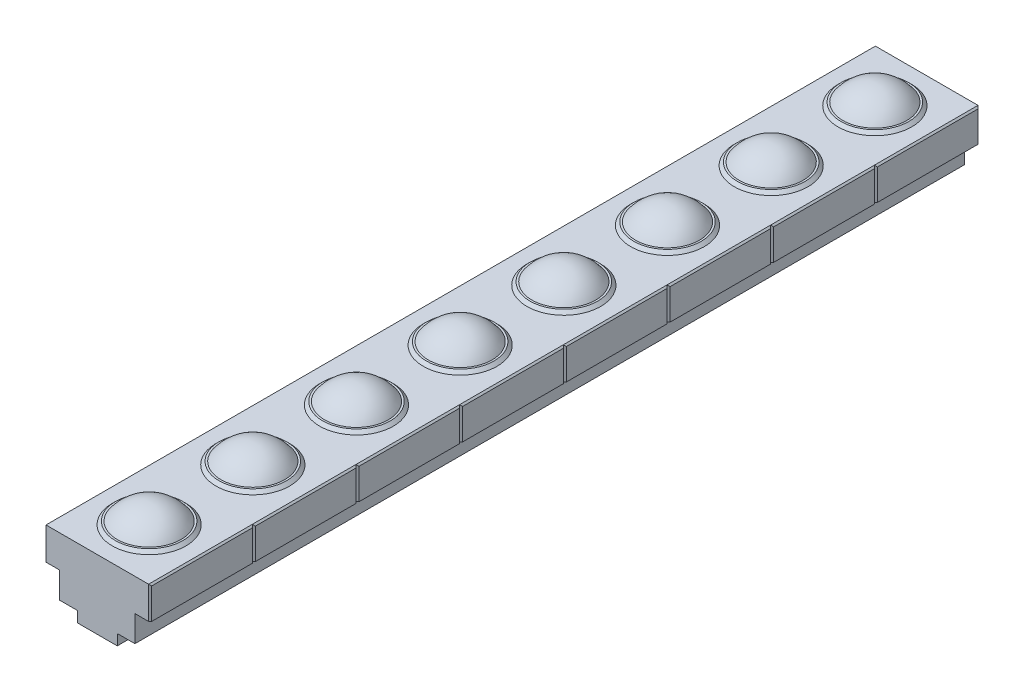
ISO-10303-21;
HEADER;
FILE_DESCRIPTION(('STEP AP214'),'2;1');
FILE_NAME('part.step','',(''),(''),'','','');
FILE_SCHEMA(('AUTOMOTIVE_DESIGN { 1 0 10303 214 1 1 1 1 }'));
ENDSEC;
DATA;
#1=APPLICATION_CONTEXT('core data for automotive mechanical design processes');
#2=APPLICATION_PROTOCOL_DEFINITION('international standard','automotive_design',2000,#1);
#3=PRODUCT_CONTEXT('',#1,'mechanical');
#4=PRODUCT('Part','Part','',(#3));
#5=PRODUCT_RELATED_PRODUCT_CATEGORY('part','',(#4));
#6=PRODUCT_DEFINITION_FORMATION('','',#4);
#7=PRODUCT_DEFINITION_CONTEXT('part definition',#1,'design');
#8=PRODUCT_DEFINITION('design','',#6,#7);
#9=PRODUCT_DEFINITION_SHAPE('','',#8);
#10=(LENGTH_UNIT() NAMED_UNIT(*) SI_UNIT(.MILLI.,.METRE.));
#11=(NAMED_UNIT(*) PLANE_ANGLE_UNIT() SI_UNIT($,.RADIAN.));
#12=(NAMED_UNIT(*) SI_UNIT($,.STERADIAN.) SOLID_ANGLE_UNIT());
#13=UNCERTAINTY_MEASURE_WITH_UNIT(LENGTH_MEASURE(1.E-05),#10,'distance_accuracy_value','');
#14=(GEOMETRIC_REPRESENTATION_CONTEXT(3) GLOBAL_UNCERTAINTY_ASSIGNED_CONTEXT((#13)) GLOBAL_UNIT_ASSIGNED_CONTEXT((#10,
#11,#12)) REPRESENTATION_CONTEXT('',''));
#15=CARTESIAN_POINT('',(0.,0.,0.));
#16=DIRECTION('',(0.,0.,1.));
#17=DIRECTION('',(1.,0.,0.));
#18=AXIS2_PLACEMENT_3D('',#15,#16,#17);
#19=CARTESIAN_POINT('',(16.7,10.5,16.875));
#20=DIRECTION('',(0.,-1.,0.));
#21=DIRECTION('',(0.,0.,-1.));
#22=AXIS2_PLACEMENT_3D('',#19,#20,#21);
#23=PLANE('',#22);
#24=DIRECTION('',(-1.,0.,0.));
#25=VECTOR('',#24,1.);
#26=CARTESIAN_POINT('',(16.7,10.5,-16.875));
#27=LINE('',#26,#25);
#28=CARTESIAN_POINT('',(16.7,10.5,-16.875));
#29=VERTEX_POINT('',#28);
#30=CARTESIAN_POINT('',(-16.7,10.5,-16.875));
#31=VERTEX_POINT('',#30);
#32=EDGE_CURVE('E880',#29,#31,#27,.T.);
#33=ORIENTED_EDGE('',*,*,#32,.T.);
#34=DIRECTION('',(0.,0.,-1.));
#35=VECTOR('',#34,1.);
#36=CARTESIAN_POINT('',(-16.7,10.5,16.875));
#37=LINE('',#36,#35);
#38=CARTESIAN_POINT('',(-16.7,10.5,16.875));
#39=VERTEX_POINT('',#38);
#40=EDGE_CURVE('E886',#39,#31,#37,.T.);
#41=ORIENTED_EDGE('',*,*,#40,.F.);
#42=DIRECTION('',(0.,0.,-1.));
#43=VECTOR('',#42,1.);
#44=CARTESIAN_POINT('',(-16.7,10.5,50.625));
#45=LINE('',#44,#43);
#46=CARTESIAN_POINT('',(-16.7,10.5,50.625));
#47=VERTEX_POINT('',#46);
#48=EDGE_CURVE('E799',#47,#39,#45,.T.);
#49=ORIENTED_EDGE('',*,*,#48,.F.);
#50=DIRECTION('',(0.,0.,-1.));
#51=VECTOR('',#50,1.);
#52=CARTESIAN_POINT('',(-16.7,10.5,84.375));
#53=LINE('',#52,#51);
#54=CARTESIAN_POINT('',(-16.7,10.5,84.375));
#55=VERTEX_POINT('',#54);
#56=EDGE_CURVE('E738',#55,#47,#53,.T.);
#57=ORIENTED_EDGE('',*,*,#56,.F.);
#58=DIRECTION('',(0.,0.,-1.));
#59=VECTOR('',#58,1.);
#60=CARTESIAN_POINT('',(-16.7,10.5,118.125));
#61=LINE('',#60,#59);
#62=CARTESIAN_POINT('',(-16.7,10.5,118.125));
#63=VERTEX_POINT('',#62);
#64=EDGE_CURVE('E677',#63,#55,#61,.T.);
#65=ORIENTED_EDGE('',*,*,#64,.F.);
#66=DIRECTION('',(0.,0.,-1.));
#67=VECTOR('',#66,1.);
#68=CARTESIAN_POINT('',(-16.7,10.5,151.875));
#69=LINE('',#68,#67);
#70=CARTESIAN_POINT('',(-16.7,10.5,151.875));
#71=VERTEX_POINT('',#70);
#72=EDGE_CURVE('E616',#71,#63,#69,.T.);
#73=ORIENTED_EDGE('',*,*,#72,.F.);
#74=DIRECTION('',(0.,0.,-1.));
#75=VECTOR('',#74,1.);
#76=CARTESIAN_POINT('',(-16.7,10.5,185.625));
#77=LINE('',#76,#75);
#78=CARTESIAN_POINT('',(-16.7,10.5,185.625));
#79=VERTEX_POINT('',#78);
#80=EDGE_CURVE('E555',#79,#71,#77,.T.);
#81=ORIENTED_EDGE('',*,*,#80,.F.);
#82=DIRECTION('',(0.,0.,-1.));
#83=VECTOR('',#82,1.);
#84=CARTESIAN_POINT('',(-16.7,10.5,219.375));
#85=LINE('',#84,#83);
#86=CARTESIAN_POINT('',(-16.7,10.5,219.375));
#87=VERTEX_POINT('',#86);
#88=EDGE_CURVE('E494',#87,#79,#85,.T.);
#89=ORIENTED_EDGE('',*,*,#88,.F.);
#90=DIRECTION('',(0.,0.,-1.));
#91=VECTOR('',#90,1.);
#92=CARTESIAN_POINT('',(-16.7,10.5,253.125));
#93=LINE('',#92,#91);
#94=CARTESIAN_POINT('',(-16.7,10.5,253.125));
#95=VERTEX_POINT('',#94);
#96=EDGE_CURVE('E435',#95,#87,#93,.T.);
#97=ORIENTED_EDGE('',*,*,#96,.F.);
#98=DIRECTION('',(-1.,0.,0.));
#99=VECTOR('',#98,1.);
#100=CARTESIAN_POINT('',(16.7,10.5,253.125));
#101=LINE('',#100,#99);
#102=CARTESIAN_POINT('',(16.7,10.5,253.125));
#103=VERTEX_POINT('',#102);
#104=EDGE_CURVE('E430',#103,#95,#101,.T.);
#105=ORIENTED_EDGE('',*,*,#104,.F.);
#106=DIRECTION('',(0.,0.,-1.));
#107=VECTOR('',#106,1.);
#108=CARTESIAN_POINT('',(16.7,10.5,253.125));
#109=LINE('',#108,#107);
#110=CARTESIAN_POINT('',(16.7,10.5,219.375));
#111=VERTEX_POINT('',#110);
#112=EDGE_CURVE('E438',#103,#111,#109,.T.);
#113=ORIENTED_EDGE('',*,*,#112,.T.);
#114=DIRECTION('',(0.,0.,-1.));
#115=VECTOR('',#114,1.);
#116=CARTESIAN_POINT('',(16.7,10.5,219.375));
#117=LINE('',#116,#115);
#118=CARTESIAN_POINT('',(16.7,10.5,185.625));
#119=VERTEX_POINT('',#118);
#120=EDGE_CURVE('E497',#111,#119,#117,.T.);
#121=ORIENTED_EDGE('',*,*,#120,.T.);
#122=DIRECTION('',(0.,0.,-1.));
#123=VECTOR('',#122,1.);
#124=CARTESIAN_POINT('',(16.7,10.5,185.625));
#125=LINE('',#124,#123);
#126=CARTESIAN_POINT('',(16.7,10.5,151.875));
#127=VERTEX_POINT('',#126);
#128=EDGE_CURVE('E558',#119,#127,#125,.T.);
#129=ORIENTED_EDGE('',*,*,#128,.T.);
#130=DIRECTION('',(0.,0.,-1.));
#131=VECTOR('',#130,1.);
#132=CARTESIAN_POINT('',(16.7,10.5,151.875));
#133=LINE('',#132,#131);
#134=CARTESIAN_POINT('',(16.7,10.5,118.125));
#135=VERTEX_POINT('',#134);
#136=EDGE_CURVE('E619',#127,#135,#133,.T.);
#137=ORIENTED_EDGE('',*,*,#136,.T.);
#138=DIRECTION('',(0.,0.,-1.));
#139=VECTOR('',#138,1.);
#140=CARTESIAN_POINT('',(16.7,10.5,118.125));
#141=LINE('',#140,#139);
#142=CARTESIAN_POINT('',(16.7,10.5,84.375));
#143=VERTEX_POINT('',#142);
#144=EDGE_CURVE('E680',#135,#143,#141,.T.);
#145=ORIENTED_EDGE('',*,*,#144,.T.);
#146=DIRECTION('',(0.,0.,-1.));
#147=VECTOR('',#146,1.);
#148=CARTESIAN_POINT('',(16.7,10.5,84.375));
#149=LINE('',#148,#147);
#150=CARTESIAN_POINT('',(16.7,10.5,50.625));
#151=VERTEX_POINT('',#150);
#152=EDGE_CURVE('E741',#143,#151,#149,.T.);
#153=ORIENTED_EDGE('',*,*,#152,.T.);
#154=DIRECTION('',(0.,0.,-1.));
#155=VECTOR('',#154,1.);
#156=CARTESIAN_POINT('',(16.7,10.5,50.625));
#157=LINE('',#156,#155);
#158=CARTESIAN_POINT('',(16.7,10.5,16.875));
#159=VERTEX_POINT('',#158);
#160=EDGE_CURVE('E802',#151,#159,#157,.T.);
#161=ORIENTED_EDGE('',*,*,#160,.T.);
#162=DIRECTION('',(0.,0.,-1.));
#163=VECTOR('',#162,1.);
#164=CARTESIAN_POINT('',(16.7,10.5,16.875));
#165=LINE('',#164,#163);
#166=EDGE_CURVE('E889',#159,#29,#165,.T.);
#167=ORIENTED_EDGE('',*,*,#166,.T.);
#168=EDGE_LOOP('',(#33,#41,#49,#57,#65,#73,#81,#89,#97,#105,#113,#121,#129,#137,#145,#153,#161,#167));
#169=FACE_BOUND('',#168,.T.);
#170=CARTESIAN_POINT('',(0.,10.5,0.));
#171=DIRECTION('',(0.,-1.,0.));
#172=DIRECTION('',(0.,0.,-1.));
#173=AXIS2_PLACEMENT_3D('',#170,#171,#172);
#174=CIRCLE('',#173,12.);
#175=CARTESIAN_POINT('',(0.,10.5,-12.));
#176=VERTEX_POINT('',#175);
#177=EDGE_CURVE('E920',#176,#176,#174,.F.);
#178=ORIENTED_EDGE('',*,*,#177,.F.);
#179=EDGE_LOOP('',(#178));
#180=FACE_BOUND('',#179,.T.);
#181=CARTESIAN_POINT('',(0.,10.5,33.75));
#182=DIRECTION('',(0.,-1.,0.));
#183=DIRECTION('',(0.,0.,-1.));
#184=AXIS2_PLACEMENT_3D('',#181,#182,#183);
#185=CIRCLE('',#184,12.);
#186=CARTESIAN_POINT('',(0.,10.5,21.75));
#187=VERTEX_POINT('',#186);
#188=EDGE_CURVE('E817',#187,#187,#185,.F.);
#189=ORIENTED_EDGE('',*,*,#188,.F.);
#190=EDGE_LOOP('',(#189));
#191=FACE_BOUND('',#190,.T.);
#192=CARTESIAN_POINT('',(0.,10.5,67.5));
#193=DIRECTION('',(0.,-1.,0.));
#194=DIRECTION('',(0.,0.,-1.));
#195=AXIS2_PLACEMENT_3D('',#192,#193,#194);
#196=CIRCLE('',#195,12.);
#197=CARTESIAN_POINT('',(0.,10.5,55.5));
#198=VERTEX_POINT('',#197);
#199=EDGE_CURVE('E756',#198,#198,#196,.F.);
#200=ORIENTED_EDGE('',*,*,#199,.F.);
#201=EDGE_LOOP('',(#200));
#202=FACE_BOUND('',#201,.T.);
#203=CARTESIAN_POINT('',(0.,10.5,101.25));
#204=DIRECTION('',(0.,-1.,0.));
#205=DIRECTION('',(0.,0.,-1.));
#206=AXIS2_PLACEMENT_3D('',#203,#204,#205);
#207=CIRCLE('',#206,12.);
#208=CARTESIAN_POINT('',(0.,10.5,89.25));
#209=VERTEX_POINT('',#208);
#210=EDGE_CURVE('E695',#209,#209,#207,.F.);
#211=ORIENTED_EDGE('',*,*,#210,.F.);
#212=EDGE_LOOP('',(#211));
#213=FACE_BOUND('',#212,.T.);
#214=CARTESIAN_POINT('',(0.,10.5,135.));
#215=DIRECTION('',(0.,-1.,0.));
#216=DIRECTION('',(0.,0.,-1.));
#217=AXIS2_PLACEMENT_3D('',#214,#215,#216);
#218=CIRCLE('',#217,12.);
#219=CARTESIAN_POINT('',(0.,10.5,123.));
#220=VERTEX_POINT('',#219);
#221=EDGE_CURVE('E634',#220,#220,#218,.F.);
#222=ORIENTED_EDGE('',*,*,#221,.F.);
#223=EDGE_LOOP('',(#222));
#224=FACE_BOUND('',#223,.T.);
#225=CARTESIAN_POINT('',(0.,10.5,168.75));
#226=DIRECTION('',(0.,-1.,0.));
#227=DIRECTION('',(0.,0.,-1.));
#228=AXIS2_PLACEMENT_3D('',#225,#226,#227);
#229=CIRCLE('',#228,12.);
#230=CARTESIAN_POINT('',(0.,10.5,156.75));
#231=VERTEX_POINT('',#230);
#232=EDGE_CURVE('E573',#231,#231,#229,.F.);
#233=ORIENTED_EDGE('',*,*,#232,.F.);
#234=EDGE_LOOP('',(#233));
#235=FACE_BOUND('',#234,.T.);
#236=CARTESIAN_POINT('',(0.,10.5,202.5));
#237=DIRECTION('',(0.,-1.,0.));
#238=DIRECTION('',(0.,0.,-1.));
#239=AXIS2_PLACEMENT_3D('',#236,#237,#238);
#240=CIRCLE('',#239,12.);
#241=CARTESIAN_POINT('',(0.,10.5,190.5));
#242=VERTEX_POINT('',#241);
#243=EDGE_CURVE('E512',#242,#242,#240,.F.);
#244=ORIENTED_EDGE('',*,*,#243,.F.);
#245=EDGE_LOOP('',(#244));
#246=FACE_BOUND('',#245,.T.);
#247=CARTESIAN_POINT('',(0.,10.5,236.25));
#248=DIRECTION('',(0.,-1.,0.));
#249=DIRECTION('',(0.,0.,-1.));
#250=AXIS2_PLACEMENT_3D('',#247,#248,#249);
#251=CIRCLE('',#250,12.);
#252=CARTESIAN_POINT('',(0.,10.5,224.25));
#253=VERTEX_POINT('',#252);
#254=EDGE_CURVE('E453',#253,#253,#251,.F.);
#255=ORIENTED_EDGE('',*,*,#254,.F.);
#256=EDGE_LOOP('',(#255));
#257=FACE_BOUND('',#256,.T.);
#258=ADVANCED_FACE('F14',(#169,#180,#191,#202,#213,#224,#235,#246,#257),#23,.F.);
#259=CARTESIAN_POINT('',(-17.2,10.,16.875));
#260=DIRECTION('',(1.,0.,0.));
#261=DIRECTION('',(0.,0.,-1.));
#262=AXIS2_PLACEMENT_3D('',#259,#260,#261);
#263=PLANE('',#262);
#264=DIRECTION('',(0.,0.,-1.));
#265=VECTOR('',#264,1.);
#266=CARTESIAN_POINT('',(-17.2,10.,16.875));
#267=LINE('',#266,#265);
#268=CARTESIAN_POINT('',(-17.2,10.,16.375));
#269=VERTEX_POINT('',#268);
#270=CARTESIAN_POINT('',(-17.2,10.,-16.375));
#271=VERTEX_POINT('',#270);
#272=EDGE_CURVE('E883',#269,#271,#267,.T.);
#273=ORIENTED_EDGE('',*,*,#272,.T.);
#274=DIRECTION('',(0.,-1.,0.));
#275=VECTOR('',#274,1.);
#276=CARTESIAN_POINT('',(-17.2,10.,-16.375));
#277=LINE('',#276,#275);
#278=CARTESIAN_POINT('',(-17.2,0.,-16.375));
#279=VERTEX_POINT('',#278);
#280=EDGE_CURVE('E925',#271,#279,#277,.T.);
#281=ORIENTED_EDGE('',*,*,#280,.T.);
#282=DIRECTION('',(0.,0.,-1.));
#283=VECTOR('',#282,1.);
#284=CARTESIAN_POINT('',(-17.2,0.,16.875));
#285=LINE('',#284,#283);
#286=CARTESIAN_POINT('',(-17.2,0.,16.375));
#287=VERTEX_POINT('',#286);
#288=EDGE_CURVE('E390',#287,#279,#285,.T.);
#289=ORIENTED_EDGE('',*,*,#288,.F.);
#290=DIRECTION('',(0.,1.,0.));
#291=VECTOR('',#290,1.);
#292=CARTESIAN_POINT('',(-17.2,10.,16.375));
#293=LINE('',#292,#291);
#294=EDGE_CURVE('E923',#287,#269,#293,.T.);
#295=ORIENTED_EDGE('',*,*,#294,.T.);
#296=EDGE_LOOP('',(#273,#281,#289,#295));
#297=FACE_BOUND('',#296,.T.);
#298=ADVANCED_FACE('F1098',(#297),#263,.F.);
#299=CARTESIAN_POINT('',(-17.2,0.,16.875));
#300=DIRECTION('',(0.,1.,0.));
#301=DIRECTION('',(0.,0.,1.));
#302=AXIS2_PLACEMENT_3D('',#299,#300,#301);
#303=PLANE('',#302);
#304=ORIENTED_EDGE('',*,*,#288,.T.);
#305=DIRECTION('',(-0.707106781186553,0.,0.707106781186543));
#306=VECTOR('',#305,1.);
#307=CARTESIAN_POINT('',(-17.2,0.,-16.375));
#308=LINE('',#307,#306);
#309=CARTESIAN_POINT('',(-16.7,0.,-16.875));
#310=VERTEX_POINT('',#309);
#311=EDGE_CURVE('E930',#279,#310,#308,.F.);
#312=ORIENTED_EDGE('',*,*,#311,.T.);
#313=DIRECTION('',(1.,0.,0.));
#314=VECTOR('',#313,1.);
#315=CARTESIAN_POINT('',(-17.2,0.,-16.875));
#316=LINE('',#315,#314);
#317=CARTESIAN_POINT('',(-12.25,0.,-16.875));
#318=VERTEX_POINT('',#317);
#319=EDGE_CURVE('E386',#310,#318,#316,.T.);
#320=ORIENTED_EDGE('',*,*,#319,.T.);
#321=DIRECTION('',(0.,0.,-1.));
#322=VECTOR('',#321,1.);
#323=CARTESIAN_POINT('',(-12.25,0.,16.875));
#324=LINE('',#323,#322);
#325=CARTESIAN_POINT('',(-12.25,0.,253.125));
#326=VERTEX_POINT('',#325);
#327=EDGE_CURVE('E380',#326,#318,#324,.T.);
#328=ORIENTED_EDGE('',*,*,#327,.F.);
#329=DIRECTION('',(1.,0.,0.));
#330=VECTOR('',#329,1.);
#331=CARTESIAN_POINT('',(-17.2,0.,253.125));
#332=LINE('',#331,#330);
#333=CARTESIAN_POINT('',(-16.7,0.,253.125));
#334=VERTEX_POINT('',#333);
#335=EDGE_CURVE('E384',#334,#326,#332,.T.);
#336=ORIENTED_EDGE('',*,*,#335,.F.);
#337=DIRECTION('',(-0.707106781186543,0.,-0.707106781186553));
#338=VECTOR('',#337,1.);
#339=CARTESIAN_POINT('',(-16.7,0.,253.125));
#340=LINE('',#339,#338);
#341=CARTESIAN_POINT('',(-17.2,0.,252.625));
#342=VERTEX_POINT('',#341);
#343=EDGE_CURVE('E461',#334,#342,#340,.T.);
#344=ORIENTED_EDGE('',*,*,#343,.T.);
#345=DIRECTION('',(0.,0.,-1.));
#346=VECTOR('',#345,1.);
#347=CARTESIAN_POINT('',(-17.2,0.,253.125));
#348=LINE('',#347,#346);
#349=CARTESIAN_POINT('',(-17.2,0.,219.875));
#350=VERTEX_POINT('',#349);
#351=EDGE_CURVE('E447',#342,#350,#348,.T.);
#352=ORIENTED_EDGE('',*,*,#351,.T.);
#353=DIRECTION('',(-0.707106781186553,0.,0.707106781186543));
#354=VECTOR('',#353,1.);
#355=CARTESIAN_POINT('',(-17.2,0.,219.875));
#356=LINE('',#355,#354);
#357=CARTESIAN_POINT('',(-16.7,0.,219.375));
#358=VERTEX_POINT('',#357);
#359=EDGE_CURVE('E463',#350,#358,#356,.F.);
#360=ORIENTED_EDGE('',*,*,#359,.T.);
#361=DIRECTION('',(-0.707106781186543,0.,-0.707106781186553));
#362=VECTOR('',#361,1.);
#363=CARTESIAN_POINT('',(-16.7,0.,219.375));
#364=LINE('',#363,#362);
#365=CARTESIAN_POINT('',(-17.2,0.,218.875));
#366=VERTEX_POINT('',#365);
#367=EDGE_CURVE('E520',#358,#366,#364,.T.);
#368=ORIENTED_EDGE('',*,*,#367,.T.);
#369=DIRECTION('',(0.,0.,-1.));
#370=VECTOR('',#369,1.);
#371=CARTESIAN_POINT('',(-17.2,0.,219.375));
#372=LINE('',#371,#370);
#373=CARTESIAN_POINT('',(-17.2,0.,186.125));
#374=VERTEX_POINT('',#373);
#375=EDGE_CURVE('E506',#366,#374,#372,.T.);
#376=ORIENTED_EDGE('',*,*,#375,.T.);
#377=DIRECTION('',(-0.707106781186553,0.,0.707106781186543));
#378=VECTOR('',#377,1.);
#379=CARTESIAN_POINT('',(-17.2,0.,186.125));
#380=LINE('',#379,#378);
#381=CARTESIAN_POINT('',(-16.7,0.,185.625));
#382=VERTEX_POINT('',#381);
#383=EDGE_CURVE('E522',#374,#382,#380,.F.);
#384=ORIENTED_EDGE('',*,*,#383,.T.);
#385=DIRECTION('',(-0.707106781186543,0.,-0.707106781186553));
#386=VECTOR('',#385,1.);
#387=CARTESIAN_POINT('',(-16.7,0.,185.625));
#388=LINE('',#387,#386);
#389=CARTESIAN_POINT('',(-17.2,0.,185.125));
#390=VERTEX_POINT('',#389);
#391=EDGE_CURVE('E581',#382,#390,#388,.T.);
#392=ORIENTED_EDGE('',*,*,#391,.T.);
#393=DIRECTION('',(0.,0.,-1.));
#394=VECTOR('',#393,1.);
#395=CARTESIAN_POINT('',(-17.2,0.,185.625));
#396=LINE('',#395,#394);
#397=CARTESIAN_POINT('',(-17.2,0.,152.375));
#398=VERTEX_POINT('',#397);
#399=EDGE_CURVE('E567',#390,#398,#396,.T.);
#400=ORIENTED_EDGE('',*,*,#399,.T.);
#401=DIRECTION('',(-0.707106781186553,0.,0.707106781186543));
#402=VECTOR('',#401,1.);
#403=CARTESIAN_POINT('',(-17.2,0.,152.375));
#404=LINE('',#403,#402);
#405=CARTESIAN_POINT('',(-16.7,0.,151.875));
#406=VERTEX_POINT('',#405);
#407=EDGE_CURVE('E583',#398,#406,#404,.F.);
#408=ORIENTED_EDGE('',*,*,#407,.T.);
#409=DIRECTION('',(-0.707106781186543,0.,-0.707106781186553));
#410=VECTOR('',#409,1.);
#411=CARTESIAN_POINT('',(-16.7,0.,151.875));
#412=LINE('',#411,#410);
#413=CARTESIAN_POINT('',(-17.2,0.,151.375));
#414=VERTEX_POINT('',#413);
#415=EDGE_CURVE('E642',#406,#414,#412,.T.);
#416=ORIENTED_EDGE('',*,*,#415,.T.);
#417=DIRECTION('',(0.,0.,-1.));
#418=VECTOR('',#417,1.);
#419=CARTESIAN_POINT('',(-17.2,0.,151.875));
#420=LINE('',#419,#418);
#421=CARTESIAN_POINT('',(-17.2,0.,118.625));
#422=VERTEX_POINT('',#421);
#423=EDGE_CURVE('E628',#414,#422,#420,.T.);
#424=ORIENTED_EDGE('',*,*,#423,.T.);
#425=DIRECTION('',(-0.707106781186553,0.,0.707106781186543));
#426=VECTOR('',#425,1.);
#427=CARTESIAN_POINT('',(-17.2,0.,118.625));
#428=LINE('',#427,#426);
#429=CARTESIAN_POINT('',(-16.7,0.,118.125));
#430=VERTEX_POINT('',#429);
#431=EDGE_CURVE('E644',#422,#430,#428,.F.);
#432=ORIENTED_EDGE('',*,*,#431,.T.);
#433=DIRECTION('',(-0.707106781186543,0.,-0.707106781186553));
#434=VECTOR('',#433,1.);
#435=CARTESIAN_POINT('',(-16.7,0.,118.125));
#436=LINE('',#435,#434);
#437=CARTESIAN_POINT('',(-17.2,0.,117.625));
#438=VERTEX_POINT('',#437);
#439=EDGE_CURVE('E703',#430,#438,#436,.T.);
#440=ORIENTED_EDGE('',*,*,#439,.T.);
#441=DIRECTION('',(0.,0.,-1.));
#442=VECTOR('',#441,1.);
#443=CARTESIAN_POINT('',(-17.2,0.,118.125));
#444=LINE('',#443,#442);
#445=CARTESIAN_POINT('',(-17.2,0.,84.875));
#446=VERTEX_POINT('',#445);
#447=EDGE_CURVE('E689',#438,#446,#444,.T.);
#448=ORIENTED_EDGE('',*,*,#447,.T.);
#449=DIRECTION('',(-0.707106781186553,0.,0.707106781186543));
#450=VECTOR('',#449,1.);
#451=CARTESIAN_POINT('',(-17.2,0.,84.875));
#452=LINE('',#451,#450);
#453=CARTESIAN_POINT('',(-16.7,0.,84.375));
#454=VERTEX_POINT('',#453);
#455=EDGE_CURVE('E705',#446,#454,#452,.F.);
#456=ORIENTED_EDGE('',*,*,#455,.T.);
#457=DIRECTION('',(-0.707106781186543,0.,-0.707106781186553));
#458=VECTOR('',#457,1.);
#459=CARTESIAN_POINT('',(-16.7,0.,84.375));
#460=LINE('',#459,#458);
#461=CARTESIAN_POINT('',(-17.2,0.,83.875));
#462=VERTEX_POINT('',#461);
#463=EDGE_CURVE('E764',#454,#462,#460,.T.);
#464=ORIENTED_EDGE('',*,*,#463,.T.);
#465=DIRECTION('',(0.,0.,-1.));
#466=VECTOR('',#465,1.);
#467=CARTESIAN_POINT('',(-17.2,0.,84.375));
#468=LINE('',#467,#466);
#469=CARTESIAN_POINT('',(-17.2,0.,51.125));
#470=VERTEX_POINT('',#469);
#471=EDGE_CURVE('E750',#462,#470,#468,.T.);
#472=ORIENTED_EDGE('',*,*,#471,.T.);
#473=DIRECTION('',(-0.707106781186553,0.,0.707106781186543));
#474=VECTOR('',#473,1.);
#475=CARTESIAN_POINT('',(-17.2,0.,51.125));
#476=LINE('',#475,#474);
#477=CARTESIAN_POINT('',(-16.7,0.,50.625));
#478=VERTEX_POINT('',#477);
#479=EDGE_CURVE('E766',#470,#478,#476,.F.);
#480=ORIENTED_EDGE('',*,*,#479,.T.);
#481=DIRECTION('',(-0.707106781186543,0.,-0.707106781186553));
#482=VECTOR('',#481,1.);
#483=CARTESIAN_POINT('',(-16.7,0.,50.625));
#484=LINE('',#483,#482);
#485=CARTESIAN_POINT('',(-17.2,0.,50.125));
#486=VERTEX_POINT('',#485);
#487=EDGE_CURVE('E825',#478,#486,#484,.T.);
#488=ORIENTED_EDGE('',*,*,#487,.T.);
#489=DIRECTION('',(0.,0.,-1.));
#490=VECTOR('',#489,1.);
#491=CARTESIAN_POINT('',(-17.2,0.,50.625));
#492=LINE('',#491,#490);
#493=CARTESIAN_POINT('',(-17.2,0.,17.375));
#494=VERTEX_POINT('',#493);
#495=EDGE_CURVE('E811',#486,#494,#492,.T.);
#496=ORIENTED_EDGE('',*,*,#495,.T.);
#497=DIRECTION('',(-0.707106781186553,0.,0.707106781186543));
#498=VECTOR('',#497,1.);
#499=CARTESIAN_POINT('',(-17.2,0.,17.375));
#500=LINE('',#499,#498);
#501=CARTESIAN_POINT('',(-16.7,0.,16.875));
#502=VERTEX_POINT('',#501);
#503=EDGE_CURVE('E827',#494,#502,#500,.F.);
#504=ORIENTED_EDGE('',*,*,#503,.T.);
#505=DIRECTION('',(-0.707106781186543,0.,-0.707106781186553));
#506=VECTOR('',#505,1.);
#507=CARTESIAN_POINT('',(-16.7,0.,16.875));
#508=LINE('',#507,#506);
#509=EDGE_CURVE('E928',#502,#287,#508,.T.);
#510=ORIENTED_EDGE('',*,*,#509,.T.);
#511=EDGE_LOOP('',(#304,#312,#320,#328,#336,#344,#352,#360,#368,#376,#384,#392,#400,#408,#416,
#424,#432,#440,#448,#456,#464,#472,#480,#488,#496,#504,#510));
#512=FACE_BOUND('',#511,.T.);
#513=ADVANCED_FACE('F383',(#512),#303,.F.);
#514=CARTESIAN_POINT('',(-12.25,0.,16.875));
#515=DIRECTION('',(1.,0.,0.));
#516=DIRECTION('',(0.,0.,-1.));
#517=AXIS2_PLACEMENT_3D('',#514,#515,#516);
#518=PLANE('',#517);
#519=DIRECTION('',(0.,-1.,0.));
#520=VECTOR('',#519,1.);
#521=CARTESIAN_POINT('',(-12.25,0.,-16.875));
#522=LINE('',#521,#520);
#523=CARTESIAN_POINT('',(-12.25,-8.5,-16.875));
#524=VERTEX_POINT('',#523);
#525=EDGE_CURVE('E864',#318,#524,#522,.T.);
#526=ORIENTED_EDGE('',*,*,#525,.T.);
#527=DIRECTION('',(0.,0.,-1.));
#528=VECTOR('',#527,1.);
#529=CARTESIAN_POINT('',(-12.25,-8.5,16.875));
#530=LINE('',#529,#528);
#531=CARTESIAN_POINT('',(-12.25,-8.5,253.125));
#532=VERTEX_POINT('',#531);
#533=EDGE_CURVE('E391',#532,#524,#530,.T.);
#534=ORIENTED_EDGE('',*,*,#533,.F.);
#535=DIRECTION('',(0.,-1.,0.));
#536=VECTOR('',#535,1.);
#537=CARTESIAN_POINT('',(-12.25,0.,253.125));
#538=LINE('',#537,#536);
#539=EDGE_CURVE('E399',#326,#532,#538,.T.);
#540=ORIENTED_EDGE('',*,*,#539,.F.);
#541=ORIENTED_EDGE('',*,*,#327,.T.);
#542=EDGE_LOOP('',(#526,#534,#540,#541));
#543=FACE_BOUND('',#542,.T.);
#544=ADVANCED_FACE('F405',(#543),#518,.F.);
#545=CARTESIAN_POINT('',(-12.25,-8.5,16.875));
#546=DIRECTION('',(0.,1.,0.));
#547=DIRECTION('',(0.,0.,1.));
#548=AXIS2_PLACEMENT_3D('',#545,#546,#547);
#549=PLANE('',#548);
#550=DIRECTION('',(1.,0.,0.));
#551=VECTOR('',#550,1.);
#552=CARTESIAN_POINT('',(-12.25,-8.5,-16.875));
#553=LINE('',#552,#551);
#554=CARTESIAN_POINT('',(-6.5,-8.5,-16.875));
#555=VERTEX_POINT('',#554);
#556=EDGE_CURVE('E866',#524,#555,#553,.T.);
#557=ORIENTED_EDGE('',*,*,#556,.T.);
#558=DIRECTION('',(0.,0.,-1.));
#559=VECTOR('',#558,1.);
#560=CARTESIAN_POINT('',(-6.5,-8.5,16.875));
#561=LINE('',#560,#559);
#562=CARTESIAN_POINT('',(-6.5,-8.5,253.125));
#563=VERTEX_POINT('',#562);
#564=EDGE_CURVE('E912',#563,#555,#561,.T.);
#565=ORIENTED_EDGE('',*,*,#564,.F.);
#566=DIRECTION('',(1.,0.,0.));
#567=VECTOR('',#566,1.);
#568=CARTESIAN_POINT('',(-12.25,-8.5,253.125));
#569=LINE('',#568,#567);
#570=EDGE_CURVE('E407',#532,#563,#569,.T.);
#571=ORIENTED_EDGE('',*,*,#570,.F.);
#572=ORIENTED_EDGE('',*,*,#533,.T.);
#573=EDGE_LOOP('',(#557,#565,#571,#572));
#574=FACE_BOUND('',#573,.T.);
#575=ADVANCED_FACE('F1257',(#574),#549,.F.);
#576=CARTESIAN_POINT('',(-6.5,-8.5,16.875));
#577=DIRECTION('',(1.,0.,0.));
#578=DIRECTION('',(0.,1.,0.));
#579=AXIS2_PLACEMENT_3D('',#576,#577,#578);
#580=PLANE('',#579);
#581=DIRECTION('',(0.,-1.,0.));
#582=VECTOR('',#581,1.);
#583=CARTESIAN_POINT('',(-6.5,-8.5,-16.875));
#584=LINE('',#583,#582);
#585=CARTESIAN_POINT('',(-6.5,-12.,-16.875));
#586=VERTEX_POINT('',#585);
#587=EDGE_CURVE('E868',#555,#586,#584,.T.);
#588=ORIENTED_EDGE('',*,*,#587,.T.);
#589=DIRECTION('',(0.,0.,-1.));
#590=VECTOR('',#589,1.);
#591=CARTESIAN_POINT('',(-6.5,-12.,16.875));
#592=LINE('',#591,#590);
#593=CARTESIAN_POINT('',(-6.5,-12.,253.125));
#594=VERTEX_POINT('',#593);
#595=EDGE_CURVE('E909',#594,#586,#592,.T.);
#596=ORIENTED_EDGE('',*,*,#595,.F.);
#597=DIRECTION('',(0.,-1.,0.));
#598=VECTOR('',#597,1.);
#599=CARTESIAN_POINT('',(-6.5,-8.5,253.125));
#600=LINE('',#599,#598);
#601=EDGE_CURVE('E409',#563,#594,#600,.T.);
#602=ORIENTED_EDGE('',*,*,#601,.F.);
#603=ORIENTED_EDGE('',*,*,#564,.T.);
#604=EDGE_LOOP('',(#588,#596,#602,#603));
#605=FACE_BOUND('',#604,.T.);
#606=ADVANCED_FACE('F1253',(#605),#580,.F.);
#607=CARTESIAN_POINT('',(-6.5,-12.,16.875));
#608=DIRECTION('',(0.,1.,0.));
#609=DIRECTION('',(0.,0.,1.));
#610=AXIS2_PLACEMENT_3D('',#607,#608,#609);
#611=PLANE('',#610);
#612=DIRECTION('',(1.,0.,0.));
#613=VECTOR('',#612,1.);
#614=CARTESIAN_POINT('',(-6.5,-12.,-16.875));
#615=LINE('',#614,#613);
#616=CARTESIAN_POINT('',(6.5,-12.,-16.875));
#617=VERTEX_POINT('',#616);
#618=EDGE_CURVE('E870',#586,#617,#615,.T.);
#619=ORIENTED_EDGE('',*,*,#618,.T.);
#620=DIRECTION('',(0.,0.,-1.));
#621=VECTOR('',#620,1.);
#622=CARTESIAN_POINT('',(6.5,-12.,16.875));
#623=LINE('',#622,#621);
#624=CARTESIAN_POINT('',(6.5,-12.,253.125));
#625=VERTEX_POINT('',#624);
#626=EDGE_CURVE('E906',#625,#617,#623,.T.);
#627=ORIENTED_EDGE('',*,*,#626,.F.);
#628=DIRECTION('',(1.,0.,0.));
#629=VECTOR('',#628,1.);
#630=CARTESIAN_POINT('',(-6.5,-12.,253.125));
#631=LINE('',#630,#629);
#632=EDGE_CURVE('E415',#594,#625,#631,.T.);
#633=ORIENTED_EDGE('',*,*,#632,.F.);
#634=ORIENTED_EDGE('',*,*,#595,.T.);
#635=EDGE_LOOP('',(#619,#627,#633,#634));
#636=FACE_BOUND('',#635,.T.);
#637=ADVANCED_FACE('F1249',(#636),#611,.F.);
#638=CARTESIAN_POINT('',(6.5,-12.,16.875));
#639=DIRECTION('',(-1.,0.,0.));
#640=DIRECTION('',(0.,-1.,0.));
#641=AXIS2_PLACEMENT_3D('',#638,#639,#640);
#642=PLANE('',#641);
#643=DIRECTION('',(0.,1.,0.));
#644=VECTOR('',#643,1.);
#645=CARTESIAN_POINT('',(6.5,-12.,-16.875));
#646=LINE('',#645,#644);
#647=CARTESIAN_POINT('',(6.5,-8.5,-16.875));
#648=VERTEX_POINT('',#647);
#649=EDGE_CURVE('E872',#617,#648,#646,.T.);
#650=ORIENTED_EDGE('',*,*,#649,.T.);
#651=DIRECTION('',(0.,0.,-1.));
#652=VECTOR('',#651,1.);
#653=CARTESIAN_POINT('',(6.5,-8.5,16.875));
#654=LINE('',#653,#652);
#655=CARTESIAN_POINT('',(6.5,-8.5,253.125));
#656=VERTEX_POINT('',#655);
#657=EDGE_CURVE('E903',#656,#648,#654,.T.);
#658=ORIENTED_EDGE('',*,*,#657,.F.);
#659=DIRECTION('',(0.,1.,0.));
#660=VECTOR('',#659,1.);
#661=CARTESIAN_POINT('',(6.5,-12.,253.125));
#662=LINE('',#661,#660);
#663=EDGE_CURVE('E418',#625,#656,#662,.T.);
#664=ORIENTED_EDGE('',*,*,#663,.F.);
#665=ORIENTED_EDGE('',*,*,#626,.T.);
#666=EDGE_LOOP('',(#650,#658,#664,#665));
#667=FACE_BOUND('',#666,.T.);
#668=ADVANCED_FACE('F1245',(#667),#642,.F.);
#669=CARTESIAN_POINT('',(6.5,-8.5,16.875));
#670=DIRECTION('',(0.,1.,0.));
#671=DIRECTION('',(0.,0.,1.));
#672=AXIS2_PLACEMENT_3D('',#669,#670,#671);
#673=PLANE('',#672);
#674=DIRECTION('',(1.,0.,0.));
#675=VECTOR('',#674,1.);
#676=CARTESIAN_POINT('',(6.5,-8.5,-16.875));
#677=LINE('',#676,#675);
#678=CARTESIAN_POINT('',(12.25,-8.5,-16.875));
#679=VERTEX_POINT('',#678);
#680=EDGE_CURVE('E874',#648,#679,#677,.T.);
#681=ORIENTED_EDGE('',*,*,#680,.T.);
#682=DIRECTION('',(0.,0.,-1.));
#683=VECTOR('',#682,1.);
#684=CARTESIAN_POINT('',(12.25,-8.5,16.875));
#685=LINE('',#684,#683);
#686=CARTESIAN_POINT('',(12.25,-8.5,253.125));
#687=VERTEX_POINT('',#686);
#688=EDGE_CURVE('E900',#687,#679,#685,.T.);
#689=ORIENTED_EDGE('',*,*,#688,.F.);
#690=DIRECTION('',(1.,0.,0.));
#691=VECTOR('',#690,1.);
#692=CARTESIAN_POINT('',(6.5,-8.5,253.125));
#693=LINE('',#692,#691);
#694=EDGE_CURVE('E421',#656,#687,#693,.T.);
#695=ORIENTED_EDGE('',*,*,#694,.F.);
#696=ORIENTED_EDGE('',*,*,#657,.T.);
#697=EDGE_LOOP('',(#681,#689,#695,#696));
#698=FACE_BOUND('',#697,.T.);
#699=ADVANCED_FACE('F1242',(#698),#673,.F.);
#700=CARTESIAN_POINT('',(12.25,-8.5,16.875));
#701=DIRECTION('',(-1.,0.,0.));
#702=DIRECTION('',(0.,0.,1.));
#703=AXIS2_PLACEMENT_3D('',#700,#701,#702);
#704=PLANE('',#703);
#705=DIRECTION('',(0.,1.,0.));
#706=VECTOR('',#705,1.);
#707=CARTESIAN_POINT('',(12.25,-8.5,-16.875));
#708=LINE('',#707,#706);
#709=CARTESIAN_POINT('',(12.25,0.,-16.875));
#710=VERTEX_POINT('',#709);
#711=EDGE_CURVE('E876',#679,#710,#708,.T.);
#712=ORIENTED_EDGE('',*,*,#711,.T.);
#713=DIRECTION('',(0.,0.,-1.));
#714=VECTOR('',#713,1.);
#715=CARTESIAN_POINT('',(12.25,0.,16.875));
#716=LINE('',#715,#714);
#717=CARTESIAN_POINT('',(12.25,0.,253.125));
#718=VERTEX_POINT('',#717);
#719=EDGE_CURVE('E897',#718,#710,#716,.T.);
#720=ORIENTED_EDGE('',*,*,#719,.F.);
#721=DIRECTION('',(0.,1.,0.));
#722=VECTOR('',#721,1.);
#723=CARTESIAN_POINT('',(12.25,-8.5,253.125));
#724=LINE('',#723,#722);
#725=EDGE_CURVE('E424',#687,#718,#724,.T.);
#726=ORIENTED_EDGE('',*,*,#725,.F.);
#727=ORIENTED_EDGE('',*,*,#688,.T.);
#728=EDGE_LOOP('',(#712,#720,#726,#727));
#729=FACE_BOUND('',#728,.T.);
#730=ADVANCED_FACE('F1239',(#729),#704,.F.);
#731=CARTESIAN_POINT('',(12.25,0.,16.875));
#732=DIRECTION('',(0.,1.,0.));
#733=DIRECTION('',(0.,0.,1.));
#734=AXIS2_PLACEMENT_3D('',#731,#732,#733);
#735=PLANE('',#734);
#736=DIRECTION('',(1.,0.,0.));
#737=VECTOR('',#736,1.);
#738=CARTESIAN_POINT('',(12.25,0.,-16.875));
#739=LINE('',#738,#737);
#740=CARTESIAN_POINT('',(16.7,0.,-16.875));
#741=VERTEX_POINT('',#740);
#742=EDGE_CURVE('E878',#710,#741,#739,.T.);
#743=ORIENTED_EDGE('',*,*,#742,.T.);
#744=DIRECTION('',(-0.707106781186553,0.,-0.707106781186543));
#745=VECTOR('',#744,1.);
#746=CARTESIAN_POINT('',(17.2,0.,-16.375));
#747=LINE('',#746,#745);
#748=CARTESIAN_POINT('',(17.2,0.,-16.375));
#749=VERTEX_POINT('',#748);
#750=EDGE_CURVE('E9',#741,#749,#747,.F.);
#751=ORIENTED_EDGE('',*,*,#750,.T.);
#752=DIRECTION('',(0.,0.,-1.));
#753=VECTOR('',#752,1.);
#754=CARTESIAN_POINT('',(17.2,0.,16.875));
#755=LINE('',#754,#753);
#756=CARTESIAN_POINT('',(17.2,0.,16.375));
#757=VERTEX_POINT('',#756);
#758=EDGE_CURVE('E895',#757,#749,#755,.T.);
#759=ORIENTED_EDGE('',*,*,#758,.F.);
#760=DIRECTION('',(-0.707106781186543,0.,0.707106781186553));
#761=VECTOR('',#760,1.);
#762=CARTESIAN_POINT('',(16.7,0.,16.875));
#763=LINE('',#762,#761);
#764=CARTESIAN_POINT('',(16.7,0.,16.875));
#765=VERTEX_POINT('',#764);
#766=EDGE_CURVE('E23',#757,#765,#763,.T.);
#767=ORIENTED_EDGE('',*,*,#766,.T.);
#768=DIRECTION('',(-0.707106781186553,0.,-0.707106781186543));
#769=VECTOR('',#768,1.);
#770=CARTESIAN_POINT('',(17.2,0.,17.375));
#771=LINE('',#770,#769);
#772=CARTESIAN_POINT('',(17.2,0.,17.375));
#773=VERTEX_POINT('',#772);
#774=EDGE_CURVE('E858',#765,#773,#771,.F.);
#775=ORIENTED_EDGE('',*,*,#774,.T.);
#776=DIRECTION('',(0.,0.,-1.));
#777=VECTOR('',#776,1.);
#778=CARTESIAN_POINT('',(17.2,0.,50.625));
#779=LINE('',#778,#777);
#780=CARTESIAN_POINT('',(17.2,0.,50.125));
#781=VERTEX_POINT('',#780);
#782=EDGE_CURVE('E808',#781,#773,#779,.T.);
#783=ORIENTED_EDGE('',*,*,#782,.F.);
#784=DIRECTION('',(-0.707106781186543,0.,0.707106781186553));
#785=VECTOR('',#784,1.);
#786=CARTESIAN_POINT('',(16.7,0.,50.625));
#787=LINE('',#786,#785);
#788=CARTESIAN_POINT('',(16.7,0.,50.625));
#789=VERTEX_POINT('',#788);
#790=EDGE_CURVE('E856',#781,#789,#787,.T.);
#791=ORIENTED_EDGE('',*,*,#790,.T.);
#792=DIRECTION('',(-0.707106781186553,0.,-0.707106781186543));
#793=VECTOR('',#792,1.);
#794=CARTESIAN_POINT('',(17.2,0.,51.125));
#795=LINE('',#794,#793);
#796=CARTESIAN_POINT('',(17.2,0.,51.125));
#797=VERTEX_POINT('',#796);
#798=EDGE_CURVE('E791',#789,#797,#795,.F.);
#799=ORIENTED_EDGE('',*,*,#798,.T.);
#800=DIRECTION('',(0.,0.,-1.));
#801=VECTOR('',#800,1.);
#802=CARTESIAN_POINT('',(17.2,0.,84.375));
#803=LINE('',#802,#801);
#804=CARTESIAN_POINT('',(17.2,0.,83.875));
#805=VERTEX_POINT('',#804);
#806=EDGE_CURVE('E747',#805,#797,#803,.T.);
#807=ORIENTED_EDGE('',*,*,#806,.F.);
#808=DIRECTION('',(-0.707106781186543,0.,0.707106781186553));
#809=VECTOR('',#808,1.);
#810=CARTESIAN_POINT('',(16.7,0.,84.375));
#811=LINE('',#810,#809);
#812=CARTESIAN_POINT('',(16.7,0.,84.375));
#813=VERTEX_POINT('',#812);
#814=EDGE_CURVE('E789',#805,#813,#811,.T.);
#815=ORIENTED_EDGE('',*,*,#814,.T.);
#816=DIRECTION('',(-0.707106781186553,0.,-0.707106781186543));
#817=VECTOR('',#816,1.);
#818=CARTESIAN_POINT('',(17.2,0.,84.875));
#819=LINE('',#818,#817);
#820=CARTESIAN_POINT('',(17.2,0.,84.875));
#821=VERTEX_POINT('',#820);
#822=EDGE_CURVE('E730',#813,#821,#819,.F.);
#823=ORIENTED_EDGE('',*,*,#822,.T.);
#824=DIRECTION('',(0.,0.,-1.));
#825=VECTOR('',#824,1.);
#826=CARTESIAN_POINT('',(17.2,0.,118.125));
#827=LINE('',#826,#825);
#828=CARTESIAN_POINT('',(17.2,0.,117.625));
#829=VERTEX_POINT('',#828);
#830=EDGE_CURVE('E686',#829,#821,#827,.T.);
#831=ORIENTED_EDGE('',*,*,#830,.F.);
#832=DIRECTION('',(-0.707106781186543,0.,0.707106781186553));
#833=VECTOR('',#832,1.);
#834=CARTESIAN_POINT('',(16.7,0.,118.125));
#835=LINE('',#834,#833);
#836=CARTESIAN_POINT('',(16.7,0.,118.125));
#837=VERTEX_POINT('',#836);
#838=EDGE_CURVE('E728',#829,#837,#835,.T.);
#839=ORIENTED_EDGE('',*,*,#838,.T.);
#840=DIRECTION('',(-0.707106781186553,0.,-0.707106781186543));
#841=VECTOR('',#840,1.);
#842=CARTESIAN_POINT('',(17.2,0.,118.625));
#843=LINE('',#842,#841);
#844=CARTESIAN_POINT('',(17.2,0.,118.625));
#845=VERTEX_POINT('',#844);
#846=EDGE_CURVE('E669',#837,#845,#843,.F.);
#847=ORIENTED_EDGE('',*,*,#846,.T.);
#848=DIRECTION('',(0.,0.,-1.));
#849=VECTOR('',#848,1.);
#850=CARTESIAN_POINT('',(17.2,0.,151.875));
#851=LINE('',#850,#849);
#852=CARTESIAN_POINT('',(17.2,0.,151.375));
#853=VERTEX_POINT('',#852);
#854=EDGE_CURVE('E625',#853,#845,#851,.T.);
#855=ORIENTED_EDGE('',*,*,#854,.F.);
#856=DIRECTION('',(-0.707106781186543,0.,0.707106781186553));
#857=VECTOR('',#856,1.);
#858=CARTESIAN_POINT('',(16.7,0.,151.875));
#859=LINE('',#858,#857);
#860=CARTESIAN_POINT('',(16.7,0.,151.875));
#861=VERTEX_POINT('',#860);
#862=EDGE_CURVE('E667',#853,#861,#859,.T.);
#863=ORIENTED_EDGE('',*,*,#862,.T.);
#864=DIRECTION('',(-0.707106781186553,0.,-0.707106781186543));
#865=VECTOR('',#864,1.);
#866=CARTESIAN_POINT('',(17.2,0.,152.375));
#867=LINE('',#866,#865);
#868=CARTESIAN_POINT('',(17.2,0.,152.375));
#869=VERTEX_POINT('',#868);
#870=EDGE_CURVE('E608',#861,#869,#867,.F.);
#871=ORIENTED_EDGE('',*,*,#870,.T.);
#872=DIRECTION('',(0.,0.,-1.));
#873=VECTOR('',#872,1.);
#874=CARTESIAN_POINT('',(17.2,0.,185.625));
#875=LINE('',#874,#873);
#876=CARTESIAN_POINT('',(17.2,0.,185.125));
#877=VERTEX_POINT('',#876);
#878=EDGE_CURVE('E564',#877,#869,#875,.T.);
#879=ORIENTED_EDGE('',*,*,#878,.F.);
#880=DIRECTION('',(-0.707106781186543,0.,0.707106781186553));
#881=VECTOR('',#880,1.);
#882=CARTESIAN_POINT('',(16.7,0.,185.625));
#883=LINE('',#882,#881);
#884=CARTESIAN_POINT('',(16.7,0.,185.625));
#885=VERTEX_POINT('',#884);
#886=EDGE_CURVE('E606',#877,#885,#883,.T.);
#887=ORIENTED_EDGE('',*,*,#886,.T.);
#888=DIRECTION('',(-0.707106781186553,0.,-0.707106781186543));
#889=VECTOR('',#888,1.);
#890=CARTESIAN_POINT('',(17.2,0.,186.125));
#891=LINE('',#890,#889);
#892=CARTESIAN_POINT('',(17.2,0.,186.125));
#893=VERTEX_POINT('',#892);
#894=EDGE_CURVE('E547',#885,#893,#891,.F.);
#895=ORIENTED_EDGE('',*,*,#894,.T.);
#896=DIRECTION('',(0.,0.,-1.));
#897=VECTOR('',#896,1.);
#898=CARTESIAN_POINT('',(17.2,0.,219.375));
#899=LINE('',#898,#897);
#900=CARTESIAN_POINT('',(17.2,0.,218.875));
#901=VERTEX_POINT('',#900);
#902=EDGE_CURVE('E503',#901,#893,#899,.T.);
#903=ORIENTED_EDGE('',*,*,#902,.F.);
#904=DIRECTION('',(-0.707106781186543,0.,0.707106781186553));
#905=VECTOR('',#904,1.);
#906=CARTESIAN_POINT('',(16.7,0.,219.375));
#907=LINE('',#906,#905);
#908=CARTESIAN_POINT('',(16.7,0.,219.375));
#909=VERTEX_POINT('',#908);
#910=EDGE_CURVE('E545',#901,#909,#907,.T.);
#911=ORIENTED_EDGE('',*,*,#910,.T.);
#912=DIRECTION('',(-0.707106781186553,0.,-0.707106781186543));
#913=VECTOR('',#912,1.);
#914=CARTESIAN_POINT('',(17.2,0.,219.875));
#915=LINE('',#914,#913);
#916=CARTESIAN_POINT('',(17.2,0.,219.875));
#917=VERTEX_POINT('',#916);
#918=EDGE_CURVE('E486',#909,#917,#915,.F.);
#919=ORIENTED_EDGE('',*,*,#918,.T.);
#920=DIRECTION('',(0.,0.,-1.));
#921=VECTOR('',#920,1.);
#922=CARTESIAN_POINT('',(17.2,0.,253.125));
#923=LINE('',#922,#921);
#924=CARTESIAN_POINT('',(17.2,0.,252.625));
#925=VERTEX_POINT('',#924);
#926=EDGE_CURVE('E444',#925,#917,#923,.T.);
#927=ORIENTED_EDGE('',*,*,#926,.F.);
#928=DIRECTION('',(-0.707106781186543,0.,0.707106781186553));
#929=VECTOR('',#928,1.);
#930=CARTESIAN_POINT('',(16.7,0.,253.125));
#931=LINE('',#930,#929);
#932=CARTESIAN_POINT('',(16.7,0.,253.125));
#933=VERTEX_POINT('',#932);
#934=EDGE_CURVE('E484',#925,#933,#931,.T.);
#935=ORIENTED_EDGE('',*,*,#934,.T.);
#936=DIRECTION('',(1.,0.,0.));
#937=VECTOR('',#936,1.);
#938=CARTESIAN_POINT('',(12.25,0.,253.125));
#939=LINE('',#938,#937);
#940=EDGE_CURVE('E427',#718,#933,#939,.T.);
#941=ORIENTED_EDGE('',*,*,#940,.F.);
#942=ORIENTED_EDGE('',*,*,#719,.T.);
#943=EDGE_LOOP('',(#743,#751,#759,#767,#775,#783,#791,#799,#807,#815,#823,#831,#839,#847,#855,
#863,#871,#879,#887,#895,#903,#911,#919,#927,#935,#941,#942));
#944=FACE_BOUND('',#943,.T.);
#945=ADVANCED_FACE('F948',(#944),#735,.F.);
#946=CARTESIAN_POINT('',(17.2,0.,16.875));
#947=DIRECTION('',(-1.,0.,0.));
#948=DIRECTION('',(0.,0.,1.));
#949=AXIS2_PLACEMENT_3D('',#946,#947,#948);
#950=PLANE('',#949);
#951=ORIENTED_EDGE('',*,*,#758,.T.);
#952=DIRECTION('',(0.,1.,0.));
#953=VECTOR('',#952,1.);
#954=CARTESIAN_POINT('',(17.2,0.,-16.375));
#955=LINE('',#954,#953);
#956=CARTESIAN_POINT('',(17.2,10.,-16.375));
#957=VERTEX_POINT('',#956);
#958=EDGE_CURVE('E941',#749,#957,#955,.T.);
#959=ORIENTED_EDGE('',*,*,#958,.T.);
#960=DIRECTION('',(0.,0.,-1.));
#961=VECTOR('',#960,1.);
#962=CARTESIAN_POINT('',(17.2,10.,16.875));
#963=LINE('',#962,#961);
#964=CARTESIAN_POINT('',(17.2,10.,16.375));
#965=VERTEX_POINT('',#964);
#966=EDGE_CURVE('E892',#965,#957,#963,.T.);
#967=ORIENTED_EDGE('',*,*,#966,.F.);
#968=DIRECTION('',(0.,-1.,0.));
#969=VECTOR('',#968,1.);
#970=CARTESIAN_POINT('',(17.2,0.,16.375));
#971=LINE('',#970,#969);
#972=EDGE_CURVE('E35',#965,#757,#971,.T.);
#973=ORIENTED_EDGE('',*,*,#972,.T.);
#974=EDGE_LOOP('',(#951,#959,#967,#973));
#975=FACE_BOUND('',#974,.T.);
#976=ADVANCED_FACE('F1082',(#975),#950,.F.);
#977=CARTESIAN_POINT('',(17.2,10.,16.875));
#978=DIRECTION('',(-0.707106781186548,-0.707106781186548,0.));
#979=DIRECTION('',(0.707106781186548,-0.707106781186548,0.));
#980=AXIS2_PLACEMENT_3D('',#977,#978,#979);
#981=PLANE('',#980);
#982=ORIENTED_EDGE('',*,*,#966,.T.);
#983=DIRECTION('',(0.577350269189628,-0.577350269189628,0.57735026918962));
#984=VECTOR('',#983,1.);
#985=CARTESIAN_POINT('',(20.5333333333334,6.66666666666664,-13.0416666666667));
#986=LINE('',#985,#984);
#987=EDGE_CURVE('E946',#957,#29,#986,.F.);
#988=ORIENTED_EDGE('',*,*,#987,.T.);
#989=ORIENTED_EDGE('',*,*,#166,.F.);
#990=DIRECTION('',(0.577350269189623,-0.577350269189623,-0.577350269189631));
#991=VECTOR('',#990,1.);
#992=CARTESIAN_POINT('',(20.2,7.,13.375));
#993=LINE('',#992,#991);
#994=EDGE_CURVE('E944',#159,#965,#993,.T.);
#995=ORIENTED_EDGE('',*,*,#994,.T.);
#996=EDGE_LOOP('',(#982,#988,#989,#995));
#997=FACE_BOUND('',#996,.T.);
#998=ADVANCED_FACE('F1084',(#997),#981,.F.);
#999=CARTESIAN_POINT('',(-16.7,10.5,16.875));
#1000=DIRECTION('',(0.707106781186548,-0.707106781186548,0.));
#1001=DIRECTION('',(0.707106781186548,0.707106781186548,0.));
#1002=AXIS2_PLACEMENT_3D('',#999,#1000,#1001);
#1003=PLANE('',#1002);
#1004=ORIENTED_EDGE('',*,*,#40,.T.);
#1005=DIRECTION('',(0.577350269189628,0.577350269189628,-0.57735026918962));
#1006=VECTOR('',#1005,1.);
#1007=CARTESIAN_POINT('',(-17.2,10.,-16.375));
#1008=LINE('',#1007,#1006);
#1009=EDGE_CURVE('E938',#31,#271,#1008,.F.);
#1010=ORIENTED_EDGE('',*,*,#1009,.T.);
#1011=ORIENTED_EDGE('',*,*,#272,.F.);
#1012=DIRECTION('',(0.577350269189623,0.577350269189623,0.577350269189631));
#1013=VECTOR('',#1012,1.);
#1014=CARTESIAN_POINT('',(-20.2,7.,13.375));
#1015=LINE('',#1014,#1013);
#1016=EDGE_CURVE('E936',#269,#39,#1015,.T.);
#1017=ORIENTED_EDGE('',*,*,#1016,.T.);
#1018=EDGE_LOOP('',(#1004,#1010,#1011,#1017));
#1019=FACE_BOUND('',#1018,.T.);
#1020=ADVANCED_FACE('F1089',(#1019),#1003,.F.);
#1021=CARTESIAN_POINT('',(0.,0.,-16.875));
#1022=DIRECTION('',(0.,0.,1.));
#1023=DIRECTION('',(1.,0.,0.));
#1024=AXIS2_PLACEMENT_3D('',#1021,#1022,#1023);
#1025=PLANE('',#1024);
#1026=ORIENTED_EDGE('',*,*,#319,.F.);
#1027=DIRECTION('',(0.,1.,0.));
#1028=VECTOR('',#1027,1.);
#1029=CARTESIAN_POINT('',(-16.7,0.,-16.875));
#1030=LINE('',#1029,#1028);
#1031=EDGE_CURVE('E934',#310,#31,#1030,.T.);
#1032=ORIENTED_EDGE('',*,*,#1031,.T.);
#1033=ORIENTED_EDGE('',*,*,#32,.F.);
#1034=DIRECTION('',(0.,-1.,0.));
#1035=VECTOR('',#1034,1.);
#1036=CARTESIAN_POINT('',(16.7,0.,-16.875));
#1037=LINE('',#1036,#1035);
#1038=EDGE_CURVE('E932',#29,#741,#1037,.T.);
#1039=ORIENTED_EDGE('',*,*,#1038,.T.);
#1040=ORIENTED_EDGE('',*,*,#742,.F.);
#1041=ORIENTED_EDGE('',*,*,#711,.F.);
#1042=ORIENTED_EDGE('',*,*,#680,.F.);
#1043=ORIENTED_EDGE('',*,*,#649,.F.);
#1044=ORIENTED_EDGE('',*,*,#618,.F.);
#1045=ORIENTED_EDGE('',*,*,#587,.F.);
#1046=ORIENTED_EDGE('',*,*,#556,.F.);
#1047=ORIENTED_EDGE('',*,*,#525,.F.);
#1048=EDGE_LOOP('',(#1026,#1032,#1033,#1039,#1040,#1041,#1042,#1043,#1044,#1045,#1046,#1047));
#1049=FACE_BOUND('',#1048,.T.);
#1050=ADVANCED_FACE('F1075',(#1049),#1025,.F.);
#1051=CARTESIAN_POINT('',(0.,10.5,0.));
#1052=DIRECTION('',(0.,-1.,0.));
#1053=DIRECTION('',(0.,0.,-1.));
#1054=AXIS2_PLACEMENT_3D('',#1051,#1052,#1053);
#1055=CONICAL_SURFACE('',#1054,12.,0.78539816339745);
#1056=CARTESIAN_POINT('',(0.,11.5,0.));
#1057=DIRECTION('',(0.,1.,0.));
#1058=DIRECTION('',(0.,0.,1.));
#1059=AXIS2_PLACEMENT_3D('',#1056,#1057,#1058);
#1060=CIRCLE('',#1059,11.);
#1061=CARTESIAN_POINT('',(0.,11.5,11.));
#1062=VERTEX_POINT('',#1061);
#1063=EDGE_CURVE('E860',#1062,#1062,#1060,.T.);
#1064=ORIENTED_EDGE('',*,*,#1063,.F.);
#1065=EDGE_LOOP('',(#1064));
#1066=FACE_BOUND('',#1065,.T.);
#1067=ORIENTED_EDGE('',*,*,#177,.T.);
#1068=EDGE_LOOP('',(#1067));
#1069=FACE_BOUND('',#1068,.T.);
#1070=ADVANCED_FACE('F1322',(#1066,#1069),#1055,.T.);
#1071=CARTESIAN_POINT('',(0.,11.5,11.));
#1072=DIRECTION('',(0.,-1.,0.));
#1073=DIRECTION('',(0.,0.,-1.));
#1074=AXIS2_PLACEMENT_3D('',#1071,#1072,#1073);
#1075=PLANE('',#1074);
#1076=CARTESIAN_POINT('',(0.,11.5,0.));
#1077=DIRECTION('',(0.,-1.,0.));
#1078=DIRECTION('',(0.,0.,-1.));
#1079=AXIS2_PLACEMENT_3D('',#1076,#1077,#1078);
#1080=CIRCLE('',#1079,10.3923048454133);
#1081=CARTESIAN_POINT('',(0.,11.5,-10.3923048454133));
#1082=VERTEX_POINT('',#1081);
#1083=EDGE_CURVE('E917',#1082,#1082,#1080,.F.);
#1084=ORIENTED_EDGE('',*,*,#1083,.F.);
#1085=EDGE_LOOP('',(#1084));
#1086=FACE_BOUND('',#1085,.T.);
#1087=ORIENTED_EDGE('',*,*,#1063,.T.);
#1088=EDGE_LOOP('',(#1087));
#1089=FACE_BOUND('',#1088,.T.);
#1090=ADVANCED_FACE('F1319',(#1086,#1089),#1075,.F.);
#1091=CARTESIAN_POINT('',(0.,4.2,0.));
#1092=DIRECTION('',(0.,0.,-1.));
#1093=DIRECTION('',(0.,-1.,0.));
#1094=AXIS2_PLACEMENT_3D('',#1091,#1092,#1093);
#1095=SPHERICAL_SURFACE('',#1094,12.7);
#1096=CARTESIAN_POINT('',(0.,4.2,0.));
#1097=DIRECTION('',(0.,-1.,0.));
#1098=DIRECTION('',(0.,0.,-1.));
#1099=AXIS2_PLACEMENT_3D('',#1096,#1097,#1098);
#1100=SPHERICAL_SURFACE('',#1099,12.7);
#1101=ORIENTED_EDGE('',*,*,#1083,.T.);
#1102=EDGE_LOOP('',(#1101));
#1103=FACE_BOUND('',#1102,.T.);
#1104=ADVANCED_FACE('F1273',(#1103),#1100,.T.);
#1105=CARTESIAN_POINT('',(-17.2,10.,-16.375));
#1106=DIRECTION('',(0.707106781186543,0.,0.707106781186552));
#1107=DIRECTION('',(0.,-1.,0.));
#1108=AXIS2_PLACEMENT_3D('',#1105,#1106,#1107);
#1109=PLANE('',#1108);
#1110=ORIENTED_EDGE('',*,*,#1009,.F.);
#1111=ORIENTED_EDGE('',*,*,#1031,.F.);
#1112=ORIENTED_EDGE('',*,*,#311,.F.);
#1113=ORIENTED_EDGE('',*,*,#280,.F.);
#1114=EDGE_LOOP('',(#1110,#1111,#1112,#1113));
#1115=FACE_BOUND('',#1114,.T.);
#1116=ADVANCED_FACE('F1095',(#1115),#1109,.F.);
#1117=CARTESIAN_POINT('',(-16.7,0.,16.875));
#1118=DIRECTION('',(-0.707106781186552,0.,0.707106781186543));
#1119=DIRECTION('',(0.,1.,0.));
#1120=AXIS2_PLACEMENT_3D('',#1117,#1118,#1119);
#1121=PLANE('',#1120);
#1122=ORIENTED_EDGE('',*,*,#1016,.F.);
#1123=ORIENTED_EDGE('',*,*,#294,.F.);
#1124=ORIENTED_EDGE('',*,*,#509,.F.);
#1125=DIRECTION('',(0.,1.,0.));
#1126=VECTOR('',#1125,1.);
#1127=CARTESIAN_POINT('',(-16.7,0.,16.875));
#1128=LINE('',#1127,#1126);
#1129=EDGE_CURVE('E833',#502,#39,#1128,.T.);
#1130=ORIENTED_EDGE('',*,*,#1129,.T.);
#1131=EDGE_LOOP('',(#1122,#1123,#1124,#1130));
#1132=FACE_BOUND('',#1131,.T.);
#1133=ADVANCED_FACE('F1102',(#1132),#1121,.T.);
#1134=CARTESIAN_POINT('',(17.2,0.,-16.375));
#1135=DIRECTION('',(-0.707106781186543,0.,0.707106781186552));
#1136=DIRECTION('',(0.,1.,0.));
#1137=AXIS2_PLACEMENT_3D('',#1134,#1135,#1136);
#1138=PLANE('',#1137);
#1139=ORIENTED_EDGE('',*,*,#750,.F.);
#1140=ORIENTED_EDGE('',*,*,#1038,.F.);
#1141=ORIENTED_EDGE('',*,*,#987,.F.);
#1142=ORIENTED_EDGE('',*,*,#958,.F.);
#1143=EDGE_LOOP('',(#1139,#1140,#1141,#1142));
#1144=FACE_BOUND('',#1143,.T.);
#1145=ADVANCED_FACE('F1080',(#1144),#1138,.F.);
#1146=CARTESIAN_POINT('',(16.7,0.,16.875));
#1147=DIRECTION('',(0.707106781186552,0.,0.707106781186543));
#1148=DIRECTION('',(0.,-1.,0.));
#1149=AXIS2_PLACEMENT_3D('',#1146,#1147,#1148);
#1150=PLANE('',#1149);
#1151=ORIENTED_EDGE('',*,*,#766,.F.);
#1152=ORIENTED_EDGE('',*,*,#972,.F.);
#1153=ORIENTED_EDGE('',*,*,#994,.F.);
#1154=DIRECTION('',(0.,-1.,0.));
#1155=VECTOR('',#1154,1.);
#1156=CARTESIAN_POINT('',(16.7,0.,16.875));
#1157=LINE('',#1156,#1155);
#1158=EDGE_CURVE('E830',#159,#765,#1157,.T.);
#1159=ORIENTED_EDGE('',*,*,#1158,.T.);
#1160=EDGE_LOOP('',(#1151,#1152,#1153,#1159));
#1161=FACE_BOUND('',#1160,.T.);
#1162=ADVANCED_FACE('F17',(#1161),#1150,.T.);
#1163=CARTESIAN_POINT('',(-17.2,10.,50.625));
#1164=DIRECTION('',(1.,0.,0.));
#1165=DIRECTION('',(0.,0.,-1.));
#1166=AXIS2_PLACEMENT_3D('',#1163,#1164,#1165);
#1167=PLANE('',#1166);
#1168=DIRECTION('',(0.,0.,-1.));
#1169=VECTOR('',#1168,1.);
#1170=CARTESIAN_POINT('',(-17.2,10.,50.625));
#1171=LINE('',#1170,#1169);
#1172=CARTESIAN_POINT('',(-17.2,10.,50.125));
#1173=VERTEX_POINT('',#1172);
#1174=CARTESIAN_POINT('',(-17.2,10.,17.375));
#1175=VERTEX_POINT('',#1174);
#1176=EDGE_CURVE('E796',#1173,#1175,#1171,.T.);
#1177=ORIENTED_EDGE('',*,*,#1176,.T.);
#1178=DIRECTION('',(0.,-1.,0.));
#1179=VECTOR('',#1178,1.);
#1180=CARTESIAN_POINT('',(-17.2,10.,17.375));
#1181=LINE('',#1180,#1179);
#1182=EDGE_CURVE('E822',#1175,#494,#1181,.T.);
#1183=ORIENTED_EDGE('',*,*,#1182,.T.);
#1184=ORIENTED_EDGE('',*,*,#495,.F.);
#1185=DIRECTION('',(0.,1.,0.));
#1186=VECTOR('',#1185,1.);
#1187=CARTESIAN_POINT('',(-17.2,10.,50.125));
#1188=LINE('',#1187,#1186);
#1189=EDGE_CURVE('E820',#486,#1173,#1188,.T.);
#1190=ORIENTED_EDGE('',*,*,#1189,.T.);
#1191=EDGE_LOOP('',(#1177,#1183,#1184,#1190));
#1192=FACE_BOUND('',#1191,.T.);
#1193=ADVANCED_FACE('F1115',(#1192),#1167,.F.);
#1194=CARTESIAN_POINT('',(17.2,0.,50.625));
#1195=DIRECTION('',(-1.,0.,0.));
#1196=DIRECTION('',(0.,0.,1.));
#1197=AXIS2_PLACEMENT_3D('',#1194,#1195,#1196);
#1198=PLANE('',#1197);
#1199=ORIENTED_EDGE('',*,*,#782,.T.);
#1200=DIRECTION('',(0.,1.,0.));
#1201=VECTOR('',#1200,1.);
#1202=CARTESIAN_POINT('',(17.2,0.,17.375));
#1203=LINE('',#1202,#1201);
#1204=CARTESIAN_POINT('',(17.2,10.,17.375));
#1205=VERTEX_POINT('',#1204);
#1206=EDGE_CURVE('E848',#773,#1205,#1203,.T.);
#1207=ORIENTED_EDGE('',*,*,#1206,.T.);
#1208=DIRECTION('',(0.,0.,-1.));
#1209=VECTOR('',#1208,1.);
#1210=CARTESIAN_POINT('',(17.2,10.,50.625));
#1211=LINE('',#1210,#1209);
#1212=CARTESIAN_POINT('',(17.2,10.,50.125));
#1213=VERTEX_POINT('',#1212);
#1214=EDGE_CURVE('E805',#1213,#1205,#1211,.T.);
#1215=ORIENTED_EDGE('',*,*,#1214,.F.);
#1216=DIRECTION('',(0.,-1.,0.));
#1217=VECTOR('',#1216,1.);
#1218=CARTESIAN_POINT('',(17.2,0.,50.125));
#1219=LINE('',#1218,#1217);
#1220=EDGE_CURVE('E846',#1213,#781,#1219,.T.);
#1221=ORIENTED_EDGE('',*,*,#1220,.T.);
#1222=EDGE_LOOP('',(#1199,#1207,#1215,#1221));
#1223=FACE_BOUND('',#1222,.T.);
#1224=ADVANCED_FACE('F959',(#1223),#1198,.F.);
#1225=CARTESIAN_POINT('',(17.2,10.,50.625));
#1226=DIRECTION('',(-0.707106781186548,-0.707106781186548,0.));
#1227=DIRECTION('',(0.707106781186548,-0.707106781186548,0.));
#1228=AXIS2_PLACEMENT_3D('',#1225,#1226,#1227);
#1229=PLANE('',#1228);
#1230=ORIENTED_EDGE('',*,*,#1214,.T.);
#1231=DIRECTION('',(0.577350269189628,-0.577350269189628,0.57735026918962));
#1232=VECTOR('',#1231,1.);
#1233=CARTESIAN_POINT('',(20.5333333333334,6.66666666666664,20.7083333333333));
#1234=LINE('',#1233,#1232);
#1235=EDGE_CURVE('E853',#1205,#159,#1234,.F.);
#1236=ORIENTED_EDGE('',*,*,#1235,.T.);
#1237=ORIENTED_EDGE('',*,*,#160,.F.);
#1238=DIRECTION('',(0.577350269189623,-0.577350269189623,-0.577350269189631));
#1239=VECTOR('',#1238,1.);
#1240=CARTESIAN_POINT('',(20.2,7.,47.125));
#1241=LINE('',#1240,#1239);
#1242=EDGE_CURVE('E851',#151,#1213,#1241,.T.);
#1243=ORIENTED_EDGE('',*,*,#1242,.T.);
#1244=EDGE_LOOP('',(#1230,#1236,#1237,#1243));
#1245=FACE_BOUND('',#1244,.T.);
#1246=ADVANCED_FACE('F962',(#1245),#1229,.F.);
#1247=CARTESIAN_POINT('',(-16.7,10.5,50.625));
#1248=DIRECTION('',(0.707106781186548,-0.707106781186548,0.));
#1249=DIRECTION('',(0.707106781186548,0.707106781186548,0.));
#1250=AXIS2_PLACEMENT_3D('',#1247,#1248,#1249);
#1251=PLANE('',#1250);
#1252=ORIENTED_EDGE('',*,*,#48,.T.);
#1253=DIRECTION('',(0.577350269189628,0.577350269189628,-0.57735026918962));
#1254=VECTOR('',#1253,1.);
#1255=CARTESIAN_POINT('',(-17.2,10.,17.375));
#1256=LINE('',#1255,#1254);
#1257=EDGE_CURVE('E838',#39,#1175,#1256,.F.);
#1258=ORIENTED_EDGE('',*,*,#1257,.T.);
#1259=ORIENTED_EDGE('',*,*,#1176,.F.);
#1260=DIRECTION('',(0.577350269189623,0.577350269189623,0.577350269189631));
#1261=VECTOR('',#1260,1.);
#1262=CARTESIAN_POINT('',(-20.2,7.,47.125));
#1263=LINE('',#1262,#1261);
#1264=EDGE_CURVE('E836',#1173,#47,#1263,.T.);
#1265=ORIENTED_EDGE('',*,*,#1264,.T.);
#1266=EDGE_LOOP('',(#1252,#1258,#1259,#1265));
#1267=FACE_BOUND('',#1266,.T.);
#1268=ADVANCED_FACE('F1106',(#1267),#1251,.F.);
#1269=CARTESIAN_POINT('',(0.,10.5,33.75));
#1270=DIRECTION('',(0.,-1.,0.));
#1271=DIRECTION('',(0.,0.,-1.));
#1272=AXIS2_PLACEMENT_3D('',#1269,#1270,#1271);
#1273=CONICAL_SURFACE('',#1272,12.,0.78539816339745);
#1274=CARTESIAN_POINT('',(0.,11.5,33.75));
#1275=DIRECTION('',(0.,1.,0.));
#1276=DIRECTION('',(0.,0.,1.));
#1277=AXIS2_PLACEMENT_3D('',#1274,#1275,#1276);
#1278=CIRCLE('',#1277,11.);
#1279=CARTESIAN_POINT('',(0.,11.5,44.75));
#1280=VERTEX_POINT('',#1279);
#1281=EDGE_CURVE('E793',#1280,#1280,#1278,.T.);
#1282=ORIENTED_EDGE('',*,*,#1281,.F.);
#1283=EDGE_LOOP('',(#1282));
#1284=FACE_BOUND('',#1283,.T.);
#1285=ORIENTED_EDGE('',*,*,#188,.T.);
#1286=EDGE_LOOP('',(#1285));
#1287=FACE_BOUND('',#1286,.T.);
#1288=ADVANCED_FACE('F1991',(#1284,#1287),#1273,.T.);
#1289=CARTESIAN_POINT('',(0.,11.5,44.75));
#1290=DIRECTION('',(0.,-1.,0.));
#1291=DIRECTION('',(0.,0.,-1.));
#1292=AXIS2_PLACEMENT_3D('',#1289,#1290,#1291);
#1293=PLANE('',#1292);
#1294=CARTESIAN_POINT('',(0.,11.5,33.75));
#1295=DIRECTION('',(0.,-1.,0.));
#1296=DIRECTION('',(0.,0.,-1.));
#1297=AXIS2_PLACEMENT_3D('',#1294,#1295,#1296);
#1298=CIRCLE('',#1297,10.3923048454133);
#1299=CARTESIAN_POINT('',(0.,11.5,23.3576951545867));
#1300=VERTEX_POINT('',#1299);
#1301=EDGE_CURVE('E814',#1300,#1300,#1298,.F.);
#1302=ORIENTED_EDGE('',*,*,#1301,.F.);
#1303=EDGE_LOOP('',(#1302));
#1304=FACE_BOUND('',#1303,.T.);
#1305=ORIENTED_EDGE('',*,*,#1281,.T.);
#1306=EDGE_LOOP('',(#1305));
#1307=FACE_BOUND('',#1306,.T.);
#1308=ADVANCED_FACE('F1981',(#1304,#1307),#1293,.F.);
#1309=CARTESIAN_POINT('',(0.,4.2,33.75));
#1310=DIRECTION('',(0.,0.,-1.));
#1311=DIRECTION('',(0.,-1.,0.));
#1312=AXIS2_PLACEMENT_3D('',#1309,#1310,#1311);
#1313=SPHERICAL_SURFACE('',#1312,12.7);
#1314=CARTESIAN_POINT('',(0.,4.2,33.75));
#1315=DIRECTION('',(0.,-1.,0.));
#1316=DIRECTION('',(0.,0.,-1.));
#1317=AXIS2_PLACEMENT_3D('',#1314,#1315,#1316);
#1318=SPHERICAL_SURFACE('',#1317,12.7);
#1319=ORIENTED_EDGE('',*,*,#1301,.T.);
#1320=EDGE_LOOP('',(#1319));
#1321=FACE_BOUND('',#1320,.T.);
#1322=ADVANCED_FACE('F1304',(#1321),#1318,.T.);
#1323=CARTESIAN_POINT('',(-17.2,10.,17.375));
#1324=DIRECTION('',(0.707106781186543,0.,0.707106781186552));
#1325=DIRECTION('',(0.,-1.,0.));
#1326=AXIS2_PLACEMENT_3D('',#1323,#1324,#1325);
#1327=PLANE('',#1326);
#1328=ORIENTED_EDGE('',*,*,#1257,.F.);
#1329=ORIENTED_EDGE('',*,*,#1129,.F.);
#1330=ORIENTED_EDGE('',*,*,#503,.F.);
#1331=ORIENTED_EDGE('',*,*,#1182,.F.);
#1332=EDGE_LOOP('',(#1328,#1329,#1330,#1331));
#1333=FACE_BOUND('',#1332,.T.);
#1334=ADVANCED_FACE('F1112',(#1333),#1327,.F.);
#1335=CARTESIAN_POINT('',(-16.7,0.,50.625));
#1336=DIRECTION('',(-0.707106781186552,0.,0.707106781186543));
#1337=DIRECTION('',(0.,1.,0.));
#1338=AXIS2_PLACEMENT_3D('',#1335,#1336,#1337);
#1339=PLANE('',#1338);
#1340=ORIENTED_EDGE('',*,*,#1264,.F.);
#1341=ORIENTED_EDGE('',*,*,#1189,.F.);
#1342=ORIENTED_EDGE('',*,*,#487,.F.);
#1343=DIRECTION('',(0.,-1.,0.));
#1344=VECTOR('',#1343,1.);
#1345=CARTESIAN_POINT('',(-16.7,0.,50.625));
#1346=LINE('',#1345,#1344);
#1347=EDGE_CURVE('E843',#47,#478,#1346,.T.);
#1348=ORIENTED_EDGE('',*,*,#1347,.F.);
#1349=EDGE_LOOP('',(#1340,#1341,#1342,#1348));
#1350=FACE_BOUND('',#1349,.T.);
#1351=ADVANCED_FACE('F1118',(#1350),#1339,.T.);
#1352=CARTESIAN_POINT('',(17.2,0.,17.375));
#1353=DIRECTION('',(-0.707106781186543,0.,0.707106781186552));
#1354=DIRECTION('',(0.,1.,0.));
#1355=AXIS2_PLACEMENT_3D('',#1352,#1353,#1354);
#1356=PLANE('',#1355);
#1357=ORIENTED_EDGE('',*,*,#774,.F.);
#1358=ORIENTED_EDGE('',*,*,#1158,.F.);
#1359=ORIENTED_EDGE('',*,*,#1235,.F.);
#1360=ORIENTED_EDGE('',*,*,#1206,.F.);
#1361=EDGE_LOOP('',(#1357,#1358,#1359,#1360));
#1362=FACE_BOUND('',#1361,.T.);
#1363=ADVANCED_FACE('F956',(#1362),#1356,.F.);
#1364=CARTESIAN_POINT('',(16.7,0.,50.625));
#1365=DIRECTION('',(0.707106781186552,0.,0.707106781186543));
#1366=DIRECTION('',(0.,-1.,0.));
#1367=AXIS2_PLACEMENT_3D('',#1364,#1365,#1366);
#1368=PLANE('',#1367);
#1369=ORIENTED_EDGE('',*,*,#790,.F.);
#1370=ORIENTED_EDGE('',*,*,#1220,.F.);
#1371=ORIENTED_EDGE('',*,*,#1242,.F.);
#1372=DIRECTION('',(0.,1.,0.));
#1373=VECTOR('',#1372,1.);
#1374=CARTESIAN_POINT('',(16.7,10.,50.625));
#1375=LINE('',#1374,#1373);
#1376=EDGE_CURVE('E840',#789,#151,#1375,.T.);
#1377=ORIENTED_EDGE('',*,*,#1376,.F.);
#1378=EDGE_LOOP('',(#1369,#1370,#1371,#1377));
#1379=FACE_BOUND('',#1378,.T.);
#1380=ADVANCED_FACE('F967',(#1379),#1368,.T.);
#1381=CARTESIAN_POINT('',(-17.2,10.,84.375));
#1382=DIRECTION('',(1.,0.,0.));
#1383=DIRECTION('',(0.,0.,-1.));
#1384=AXIS2_PLACEMENT_3D('',#1381,#1382,#1383);
#1385=PLANE('',#1384);
#1386=DIRECTION('',(0.,0.,-1.));
#1387=VECTOR('',#1386,1.);
#1388=CARTESIAN_POINT('',(-17.2,10.,84.375));
#1389=LINE('',#1388,#1387);
#1390=CARTESIAN_POINT('',(-17.2,10.,83.875));
#1391=VERTEX_POINT('',#1390);
#1392=CARTESIAN_POINT('',(-17.2,10.,51.125));
#1393=VERTEX_POINT('',#1392);
#1394=EDGE_CURVE('E735',#1391,#1393,#1389,.T.);
#1395=ORIENTED_EDGE('',*,*,#1394,.T.);
#1396=DIRECTION('',(0.,-1.,0.));
#1397=VECTOR('',#1396,1.);
#1398=CARTESIAN_POINT('',(-17.2,10.,51.125));
#1399=LINE('',#1398,#1397);
#1400=EDGE_CURVE('E761',#1393,#470,#1399,.T.);
#1401=ORIENTED_EDGE('',*,*,#1400,.T.);
#1402=ORIENTED_EDGE('',*,*,#471,.F.);
#1403=DIRECTION('',(0.,1.,0.));
#1404=VECTOR('',#1403,1.);
#1405=CARTESIAN_POINT('',(-17.2,10.,83.875));
#1406=LINE('',#1405,#1404);
#1407=EDGE_CURVE('E759',#462,#1391,#1406,.T.);
#1408=ORIENTED_EDGE('',*,*,#1407,.T.);
#1409=EDGE_LOOP('',(#1395,#1401,#1402,#1408));
#1410=FACE_BOUND('',#1409,.T.);
#1411=ADVANCED_FACE('F1131',(#1410),#1385,.F.);
#1412=CARTESIAN_POINT('',(17.2,0.,84.375));
#1413=DIRECTION('',(-1.,0.,0.));
#1414=DIRECTION('',(0.,0.,1.));
#1415=AXIS2_PLACEMENT_3D('',#1412,#1413,#1414);
#1416=PLANE('',#1415);
#1417=ORIENTED_EDGE('',*,*,#806,.T.);
#1418=DIRECTION('',(0.,1.,0.));
#1419=VECTOR('',#1418,1.);
#1420=CARTESIAN_POINT('',(17.2,0.,51.125));
#1421=LINE('',#1420,#1419);
#1422=CARTESIAN_POINT('',(17.2,10.,51.125));
#1423=VERTEX_POINT('',#1422);
#1424=EDGE_CURVE('E781',#797,#1423,#1421,.T.);
#1425=ORIENTED_EDGE('',*,*,#1424,.T.);
#1426=DIRECTION('',(0.,0.,-1.));
#1427=VECTOR('',#1426,1.);
#1428=CARTESIAN_POINT('',(17.2,10.,84.375));
#1429=LINE('',#1428,#1427);
#1430=CARTESIAN_POINT('',(17.2,10.,83.875));
#1431=VERTEX_POINT('',#1430);
#1432=EDGE_CURVE('E744',#1431,#1423,#1429,.T.);
#1433=ORIENTED_EDGE('',*,*,#1432,.F.);
#1434=DIRECTION('',(0.,-1.,0.));
#1435=VECTOR('',#1434,1.);
#1436=CARTESIAN_POINT('',(17.2,0.,83.875));
#1437=LINE('',#1436,#1435);
#1438=EDGE_CURVE('E779',#1431,#805,#1437,.T.);
#1439=ORIENTED_EDGE('',*,*,#1438,.T.);
#1440=EDGE_LOOP('',(#1417,#1425,#1433,#1439));
#1441=FACE_BOUND('',#1440,.T.);
#1442=ADVANCED_FACE('F981',(#1441),#1416,.F.);
#1443=CARTESIAN_POINT('',(17.2,10.,84.375));
#1444=DIRECTION('',(-0.707106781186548,-0.707106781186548,0.));
#1445=DIRECTION('',(0.707106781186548,-0.707106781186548,0.));
#1446=AXIS2_PLACEMENT_3D('',#1443,#1444,#1445);
#1447=PLANE('',#1446);
#1448=ORIENTED_EDGE('',*,*,#1432,.T.);
#1449=DIRECTION('',(0.577350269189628,-0.577350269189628,0.57735026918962));
#1450=VECTOR('',#1449,1.);
#1451=CARTESIAN_POINT('',(20.5333333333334,6.66666666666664,54.4583333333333));
#1452=LINE('',#1451,#1450);
#1453=EDGE_CURVE('E786',#1423,#151,#1452,.F.);
#1454=ORIENTED_EDGE('',*,*,#1453,.T.);
#1455=ORIENTED_EDGE('',*,*,#152,.F.);
#1456=DIRECTION('',(0.577350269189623,-0.577350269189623,-0.577350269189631));
#1457=VECTOR('',#1456,1.);
#1458=CARTESIAN_POINT('',(20.2,7.,80.875));
#1459=LINE('',#1458,#1457);
#1460=EDGE_CURVE('E784',#143,#1431,#1459,.T.);
#1461=ORIENTED_EDGE('',*,*,#1460,.T.);
#1462=EDGE_LOOP('',(#1448,#1454,#1455,#1461));
#1463=FACE_BOUND('',#1462,.T.);
#1464=ADVANCED_FACE('F970',(#1463),#1447,.F.);
#1465=CARTESIAN_POINT('',(-16.7,10.5,84.375));
#1466=DIRECTION('',(0.707106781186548,-0.707106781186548,0.));
#1467=DIRECTION('',(0.707106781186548,0.707106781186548,0.));
#1468=AXIS2_PLACEMENT_3D('',#1465,#1466,#1467);
#1469=PLANE('',#1468);
#1470=ORIENTED_EDGE('',*,*,#56,.T.);
#1471=DIRECTION('',(0.577350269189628,0.577350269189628,-0.57735026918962));
#1472=VECTOR('',#1471,1.);
#1473=CARTESIAN_POINT('',(-17.2,10.,51.125));
#1474=LINE('',#1473,#1472);
#1475=EDGE_CURVE('E771',#47,#1393,#1474,.F.);
#1476=ORIENTED_EDGE('',*,*,#1475,.T.);
#1477=ORIENTED_EDGE('',*,*,#1394,.F.);
#1478=DIRECTION('',(0.577350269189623,0.577350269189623,0.577350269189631));
#1479=VECTOR('',#1478,1.);
#1480=CARTESIAN_POINT('',(-20.2,7.,80.875));
#1481=LINE('',#1480,#1479);
#1482=EDGE_CURVE('E769',#1391,#55,#1481,.T.);
#1483=ORIENTED_EDGE('',*,*,#1482,.T.);
#1484=EDGE_LOOP('',(#1470,#1476,#1477,#1483));
#1485=FACE_BOUND('',#1484,.T.);
#1486=ADVANCED_FACE('F1122',(#1485),#1469,.F.);
#1487=CARTESIAN_POINT('',(0.,10.5,67.5));
#1488=DIRECTION('',(0.,-1.,0.));
#1489=DIRECTION('',(0.,0.,-1.));
#1490=AXIS2_PLACEMENT_3D('',#1487,#1488,#1489);
#1491=CONICAL_SURFACE('',#1490,12.,0.78539816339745);
#1492=CARTESIAN_POINT('',(0.,11.5,67.5));
#1493=DIRECTION('',(0.,1.,0.));
#1494=DIRECTION('',(0.,0.,1.));
#1495=AXIS2_PLACEMENT_3D('',#1492,#1493,#1494);
#1496=CIRCLE('',#1495,11.);
#1497=CARTESIAN_POINT('',(0.,11.5,78.5));
#1498=VERTEX_POINT('',#1497);
#1499=EDGE_CURVE('E732',#1498,#1498,#1496,.T.);
#1500=ORIENTED_EDGE('',*,*,#1499,.F.);
#1501=EDGE_LOOP('',(#1500));
#1502=FACE_BOUND('',#1501,.T.);
#1503=ORIENTED_EDGE('',*,*,#199,.T.);
#1504=EDGE_LOOP('',(#1503));
#1505=FACE_BOUND('',#1504,.T.);
#1506=ADVANCED_FACE('F1930',(#1502,#1505),#1491,.T.);
#1507=CARTESIAN_POINT('',(0.,11.5,78.5));
#1508=DIRECTION('',(0.,-1.,0.));
#1509=DIRECTION('',(0.,0.,-1.));
#1510=AXIS2_PLACEMENT_3D('',#1507,#1508,#1509);
#1511=PLANE('',#1510);
#1512=CARTESIAN_POINT('',(0.,11.5,67.5));
#1513=DIRECTION('',(0.,-1.,0.));
#1514=DIRECTION('',(0.,0.,-1.));
#1515=AXIS2_PLACEMENT_3D('',#1512,#1513,#1514);
#1516=CIRCLE('',#1515,10.3923048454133);
#1517=CARTESIAN_POINT('',(0.,11.5,57.1076951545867));
#1518=VERTEX_POINT('',#1517);
#1519=EDGE_CURVE('E753',#1518,#1518,#1516,.F.);
#1520=ORIENTED_EDGE('',*,*,#1519,.F.);
#1521=EDGE_LOOP('',(#1520));
#1522=FACE_BOUND('',#1521,.T.);
#1523=ORIENTED_EDGE('',*,*,#1499,.T.);
#1524=EDGE_LOOP('',(#1523));
#1525=FACE_BOUND('',#1524,.T.);
#1526=ADVANCED_FACE('F1920',(#1522,#1525),#1511,.F.);
#1527=CARTESIAN_POINT('',(0.,4.2,67.5));
#1528=DIRECTION('',(0.,0.,-1.));
#1529=DIRECTION('',(0.,-1.,0.));
#1530=AXIS2_PLACEMENT_3D('',#1527,#1528,#1529);
#1531=SPHERICAL_SURFACE('',#1530,12.7);
#1532=CARTESIAN_POINT('',(0.,4.2,67.5));
#1533=DIRECTION('',(0.,-1.,0.));
#1534=DIRECTION('',(0.,0.,-1.));
#1535=AXIS2_PLACEMENT_3D('',#1532,#1533,#1534);
#1536=SPHERICAL_SURFACE('',#1535,12.7);
#1537=ORIENTED_EDGE('',*,*,#1519,.T.);
#1538=EDGE_LOOP('',(#1537));
#1539=FACE_BOUND('',#1538,.T.);
#1540=ADVANCED_FACE('F1911',(#1539),#1536,.T.);
#1541=CARTESIAN_POINT('',(-17.2,10.,51.125));
#1542=DIRECTION('',(0.707106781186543,0.,0.707106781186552));
#1543=DIRECTION('',(0.,-1.,0.));
#1544=AXIS2_PLACEMENT_3D('',#1541,#1542,#1543);
#1545=PLANE('',#1544);
#1546=ORIENTED_EDGE('',*,*,#1475,.F.);
#1547=ORIENTED_EDGE('',*,*,#1347,.T.);
#1548=ORIENTED_EDGE('',*,*,#479,.F.);
#1549=ORIENTED_EDGE('',*,*,#1400,.F.);
#1550=EDGE_LOOP('',(#1546,#1547,#1548,#1549));
#1551=FACE_BOUND('',#1550,.T.);
#1552=ADVANCED_FACE('F1128',(#1551),#1545,.F.);
#1553=CARTESIAN_POINT('',(-16.7,0.,84.375));
#1554=DIRECTION('',(-0.707106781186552,0.,0.707106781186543));
#1555=DIRECTION('',(0.,1.,0.));
#1556=AXIS2_PLACEMENT_3D('',#1553,#1554,#1555);
#1557=PLANE('',#1556);
#1558=ORIENTED_EDGE('',*,*,#1482,.F.);
#1559=ORIENTED_EDGE('',*,*,#1407,.F.);
#1560=ORIENTED_EDGE('',*,*,#463,.F.);
#1561=DIRECTION('',(0.,-1.,0.));
#1562=VECTOR('',#1561,1.);
#1563=CARTESIAN_POINT('',(-16.7,0.,84.375));
#1564=LINE('',#1563,#1562);
#1565=EDGE_CURVE('E776',#55,#454,#1564,.T.);
#1566=ORIENTED_EDGE('',*,*,#1565,.F.);
#1567=EDGE_LOOP('',(#1558,#1559,#1560,#1566));
#1568=FACE_BOUND('',#1567,.T.);
#1569=ADVANCED_FACE('F1134',(#1568),#1557,.T.);
#1570=CARTESIAN_POINT('',(17.2,0.,51.125));
#1571=DIRECTION('',(-0.707106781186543,0.,0.707106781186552));
#1572=DIRECTION('',(0.,1.,0.));
#1573=AXIS2_PLACEMENT_3D('',#1570,#1571,#1572);
#1574=PLANE('',#1573);
#1575=ORIENTED_EDGE('',*,*,#798,.F.);
#1576=ORIENTED_EDGE('',*,*,#1376,.T.);
#1577=ORIENTED_EDGE('',*,*,#1453,.F.);
#1578=ORIENTED_EDGE('',*,*,#1424,.F.);
#1579=EDGE_LOOP('',(#1575,#1576,#1577,#1578));
#1580=FACE_BOUND('',#1579,.T.);
#1581=ADVANCED_FACE('F977',(#1580),#1574,.F.);
#1582=CARTESIAN_POINT('',(16.7,0.,84.375));
#1583=DIRECTION('',(0.707106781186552,0.,0.707106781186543));
#1584=DIRECTION('',(0.,-1.,0.));
#1585=AXIS2_PLACEMENT_3D('',#1582,#1583,#1584);
#1586=PLANE('',#1585);
#1587=ORIENTED_EDGE('',*,*,#814,.F.);
#1588=ORIENTED_EDGE('',*,*,#1438,.F.);
#1589=ORIENTED_EDGE('',*,*,#1460,.F.);
#1590=DIRECTION('',(0.,1.,0.));
#1591=VECTOR('',#1590,1.);
#1592=CARTESIAN_POINT('',(16.7,10.,84.375));
#1593=LINE('',#1592,#1591);
#1594=EDGE_CURVE('E773',#813,#143,#1593,.T.);
#1595=ORIENTED_EDGE('',*,*,#1594,.F.);
#1596=EDGE_LOOP('',(#1587,#1588,#1589,#1595));
#1597=FACE_BOUND('',#1596,.T.);
#1598=ADVANCED_FACE('F984',(#1597),#1586,.T.);
#1599=CARTESIAN_POINT('',(-17.2,10.,118.125));
#1600=DIRECTION('',(1.,0.,0.));
#1601=DIRECTION('',(0.,0.,-1.));
#1602=AXIS2_PLACEMENT_3D('',#1599,#1600,#1601);
#1603=PLANE('',#1602);
#1604=DIRECTION('',(0.,0.,-1.));
#1605=VECTOR('',#1604,1.);
#1606=CARTESIAN_POINT('',(-17.2,10.,118.125));
#1607=LINE('',#1606,#1605);
#1608=CARTESIAN_POINT('',(-17.2,10.,117.625));
#1609=VERTEX_POINT('',#1608);
#1610=CARTESIAN_POINT('',(-17.2,10.,84.875));
#1611=VERTEX_POINT('',#1610);
#1612=EDGE_CURVE('E674',#1609,#1611,#1607,.T.);
#1613=ORIENTED_EDGE('',*,*,#1612,.T.);
#1614=DIRECTION('',(0.,-1.,0.));
#1615=VECTOR('',#1614,1.);
#1616=CARTESIAN_POINT('',(-17.2,10.,84.875));
#1617=LINE('',#1616,#1615);
#1618=EDGE_CURVE('E700',#1611,#446,#1617,.T.);
#1619=ORIENTED_EDGE('',*,*,#1618,.T.);
#1620=ORIENTED_EDGE('',*,*,#447,.F.);
#1621=DIRECTION('',(0.,1.,0.));
#1622=VECTOR('',#1621,1.);
#1623=CARTESIAN_POINT('',(-17.2,10.,117.625));
#1624=LINE('',#1623,#1622);
#1625=EDGE_CURVE('E698',#438,#1609,#1624,.T.);
#1626=ORIENTED_EDGE('',*,*,#1625,.T.);
#1627=EDGE_LOOP('',(#1613,#1619,#1620,#1626));
#1628=FACE_BOUND('',#1627,.T.);
#1629=ADVANCED_FACE('F1147',(#1628),#1603,.F.);
#1630=CARTESIAN_POINT('',(17.2,0.,118.125));
#1631=DIRECTION('',(-1.,0.,0.));
#1632=DIRECTION('',(0.,0.,1.));
#1633=AXIS2_PLACEMENT_3D('',#1630,#1631,#1632);
#1634=PLANE('',#1633);
#1635=ORIENTED_EDGE('',*,*,#830,.T.);
#1636=DIRECTION('',(0.,1.,0.));
#1637=VECTOR('',#1636,1.);
#1638=CARTESIAN_POINT('',(17.2,0.,84.875));
#1639=LINE('',#1638,#1637);
#1640=CARTESIAN_POINT('',(17.2,10.,84.875));
#1641=VERTEX_POINT('',#1640);
#1642=EDGE_CURVE('E720',#821,#1641,#1639,.T.);
#1643=ORIENTED_EDGE('',*,*,#1642,.T.);
#1644=DIRECTION('',(0.,0.,-1.));
#1645=VECTOR('',#1644,1.);
#1646=CARTESIAN_POINT('',(17.2,10.,118.125));
#1647=LINE('',#1646,#1645);
#1648=CARTESIAN_POINT('',(17.2,10.,117.625));
#1649=VERTEX_POINT('',#1648);
#1650=EDGE_CURVE('E683',#1649,#1641,#1647,.T.);
#1651=ORIENTED_EDGE('',*,*,#1650,.F.);
#1652=DIRECTION('',(0.,-1.,0.));
#1653=VECTOR('',#1652,1.);
#1654=CARTESIAN_POINT('',(17.2,0.,117.625));
#1655=LINE('',#1654,#1653);
#1656=EDGE_CURVE('E718',#1649,#829,#1655,.T.);
#1657=ORIENTED_EDGE('',*,*,#1656,.T.);
#1658=EDGE_LOOP('',(#1635,#1643,#1651,#1657));
#1659=FACE_BOUND('',#1658,.T.);
#1660=ADVANCED_FACE('F992',(#1659),#1634,.F.);
#1661=CARTESIAN_POINT('',(17.2,10.,118.125));
#1662=DIRECTION('',(-0.707106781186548,-0.707106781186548,0.));
#1663=DIRECTION('',(0.707106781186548,-0.707106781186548,0.));
#1664=AXIS2_PLACEMENT_3D('',#1661,#1662,#1663);
#1665=PLANE('',#1664);
#1666=ORIENTED_EDGE('',*,*,#1650,.T.);
#1667=DIRECTION('',(0.577350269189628,-0.577350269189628,0.57735026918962));
#1668=VECTOR('',#1667,1.);
#1669=CARTESIAN_POINT('',(20.5333333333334,6.66666666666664,88.2083333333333));
#1670=LINE('',#1669,#1668);
#1671=EDGE_CURVE('E725',#1641,#143,#1670,.F.);
#1672=ORIENTED_EDGE('',*,*,#1671,.T.);
#1673=ORIENTED_EDGE('',*,*,#144,.F.);
#1674=DIRECTION('',(0.577350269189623,-0.577350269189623,-0.577350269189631));
#1675=VECTOR('',#1674,1.);
#1676=CARTESIAN_POINT('',(20.2,7.,114.625));
#1677=LINE('',#1676,#1675);
#1678=EDGE_CURVE('E723',#135,#1649,#1677,.T.);
#1679=ORIENTED_EDGE('',*,*,#1678,.T.);
#1680=EDGE_LOOP('',(#1666,#1672,#1673,#1679));
#1681=FACE_BOUND('',#1680,.T.);
#1682=ADVANCED_FACE('F997',(#1681),#1665,.F.);
#1683=CARTESIAN_POINT('',(-16.7,10.5,118.125));
#1684=DIRECTION('',(0.707106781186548,-0.707106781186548,0.));
#1685=DIRECTION('',(0.707106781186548,0.707106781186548,0.));
#1686=AXIS2_PLACEMENT_3D('',#1683,#1684,#1685);
#1687=PLANE('',#1686);
#1688=ORIENTED_EDGE('',*,*,#64,.T.);
#1689=DIRECTION('',(0.577350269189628,0.577350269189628,-0.57735026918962));
#1690=VECTOR('',#1689,1.);
#1691=CARTESIAN_POINT('',(-17.2,10.,84.875));
#1692=LINE('',#1691,#1690);
#1693=EDGE_CURVE('E710',#55,#1611,#1692,.F.);
#1694=ORIENTED_EDGE('',*,*,#1693,.T.);
#1695=ORIENTED_EDGE('',*,*,#1612,.F.);
#1696=DIRECTION('',(0.577350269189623,0.577350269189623,0.577350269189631));
#1697=VECTOR('',#1696,1.);
#1698=CARTESIAN_POINT('',(-20.2,7.,114.625));
#1699=LINE('',#1698,#1697);
#1700=EDGE_CURVE('E708',#1609,#63,#1699,.T.);
#1701=ORIENTED_EDGE('',*,*,#1700,.T.);
#1702=EDGE_LOOP('',(#1688,#1694,#1695,#1701));
#1703=FACE_BOUND('',#1702,.T.);
#1704=ADVANCED_FACE('F1138',(#1703),#1687,.F.);
#1705=CARTESIAN_POINT('',(0.,10.5,101.25));
#1706=DIRECTION('',(0.,-1.,0.));
#1707=DIRECTION('',(0.,0.,-1.));
#1708=AXIS2_PLACEMENT_3D('',#1705,#1706,#1707);
#1709=CONICAL_SURFACE('',#1708,12.,0.78539816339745);
#1710=CARTESIAN_POINT('',(0.,11.5,101.25));
#1711=DIRECTION('',(0.,1.,0.));
#1712=DIRECTION('',(0.,0.,1.));
#1713=AXIS2_PLACEMENT_3D('',#1710,#1711,#1712);
#1714=CIRCLE('',#1713,11.);
#1715=CARTESIAN_POINT('',(0.,11.5,112.25));
#1716=VERTEX_POINT('',#1715);
#1717=EDGE_CURVE('E671',#1716,#1716,#1714,.T.);
#1718=ORIENTED_EDGE('',*,*,#1717,.F.);
#1719=EDGE_LOOP('',(#1718));
#1720=FACE_BOUND('',#1719,.T.);
#1721=ORIENTED_EDGE('',*,*,#210,.T.);
#1722=EDGE_LOOP('',(#1721));
#1723=FACE_BOUND('',#1722,.T.);
#1724=ADVANCED_FACE('F1836',(#1720,#1723),#1709,.T.);
#1725=CARTESIAN_POINT('',(0.,11.5,112.25));
#1726=DIRECTION('',(0.,-1.,0.));
#1727=DIRECTION('',(0.,0.,-1.));
#1728=AXIS2_PLACEMENT_3D('',#1725,#1726,#1727);
#1729=PLANE('',#1728);
#1730=CARTESIAN_POINT('',(0.,11.5,101.25));
#1731=DIRECTION('',(0.,-1.,0.));
#1732=DIRECTION('',(0.,0.,-1.));
#1733=AXIS2_PLACEMENT_3D('',#1730,#1731,#1732);
#1734=CIRCLE('',#1733,10.3923048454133);
#1735=CARTESIAN_POINT('',(0.,11.5,90.8576951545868));
#1736=VERTEX_POINT('',#1735);
#1737=EDGE_CURVE('E692',#1736,#1736,#1734,.F.);
#1738=ORIENTED_EDGE('',*,*,#1737,.F.);
#1739=EDGE_LOOP('',(#1738));
#1740=FACE_BOUND('',#1739,.T.);
#1741=ORIENTED_EDGE('',*,*,#1717,.T.);
#1742=EDGE_LOOP('',(#1741));
#1743=FACE_BOUND('',#1742,.T.);
#1744=ADVANCED_FACE('F1826',(#1740,#1743),#1729,.F.);
#1745=CARTESIAN_POINT('',(0.,4.2,101.25));
#1746=DIRECTION('',(0.,0.,-1.));
#1747=DIRECTION('',(0.,-1.,0.));
#1748=AXIS2_PLACEMENT_3D('',#1745,#1746,#1747);
#1749=SPHERICAL_SURFACE('',#1748,12.7);
#1750=CARTESIAN_POINT('',(0.,4.2,101.25));
#1751=DIRECTION('',(0.,-1.,0.));
#1752=DIRECTION('',(0.,0.,-1.));
#1753=AXIS2_PLACEMENT_3D('',#1750,#1751,#1752);
#1754=SPHERICAL_SURFACE('',#1753,12.7);
#1755=ORIENTED_EDGE('',*,*,#1737,.T.);
#1756=EDGE_LOOP('',(#1755));
#1757=FACE_BOUND('',#1756,.T.);
#1758=ADVANCED_FACE('F1817',(#1757),#1754,.T.);
#1759=CARTESIAN_POINT('',(-17.2,10.,84.875));
#1760=DIRECTION('',(0.707106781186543,0.,0.707106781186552));
#1761=DIRECTION('',(0.,-1.,0.));
#1762=AXIS2_PLACEMENT_3D('',#1759,#1760,#1761);
#1763=PLANE('',#1762);
#1764=ORIENTED_EDGE('',*,*,#1693,.F.);
#1765=ORIENTED_EDGE('',*,*,#1565,.T.);
#1766=ORIENTED_EDGE('',*,*,#455,.F.);
#1767=ORIENTED_EDGE('',*,*,#1618,.F.);
#1768=EDGE_LOOP('',(#1764,#1765,#1766,#1767));
#1769=FACE_BOUND('',#1768,.T.);
#1770=ADVANCED_FACE('F1144',(#1769),#1763,.F.);
#1771=CARTESIAN_POINT('',(-16.7,0.,118.125));
#1772=DIRECTION('',(-0.707106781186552,0.,0.707106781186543));
#1773=DIRECTION('',(0.,1.,0.));
#1774=AXIS2_PLACEMENT_3D('',#1771,#1772,#1773);
#1775=PLANE('',#1774);
#1776=ORIENTED_EDGE('',*,*,#1700,.F.);
#1777=ORIENTED_EDGE('',*,*,#1625,.F.);
#1778=ORIENTED_EDGE('',*,*,#439,.F.);
#1779=DIRECTION('',(0.,-1.,0.));
#1780=VECTOR('',#1779,1.);
#1781=CARTESIAN_POINT('',(-16.7,0.,118.125));
#1782=LINE('',#1781,#1780);
#1783=EDGE_CURVE('E715',#63,#430,#1782,.T.);
#1784=ORIENTED_EDGE('',*,*,#1783,.F.);
#1785=EDGE_LOOP('',(#1776,#1777,#1778,#1784));
#1786=FACE_BOUND('',#1785,.T.);
#1787=ADVANCED_FACE('F1150',(#1786),#1775,.T.);
#1788=CARTESIAN_POINT('',(17.2,0.,84.875));
#1789=DIRECTION('',(-0.707106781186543,0.,0.707106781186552));
#1790=DIRECTION('',(0.,1.,0.));
#1791=AXIS2_PLACEMENT_3D('',#1788,#1789,#1790);
#1792=PLANE('',#1791);
#1793=ORIENTED_EDGE('',*,*,#822,.F.);
#1794=ORIENTED_EDGE('',*,*,#1594,.T.);
#1795=ORIENTED_EDGE('',*,*,#1671,.F.);
#1796=ORIENTED_EDGE('',*,*,#1642,.F.);
#1797=EDGE_LOOP('',(#1793,#1794,#1795,#1796));
#1798=FACE_BOUND('',#1797,.T.);
#1799=ADVANCED_FACE('F995',(#1798),#1792,.F.);
#1800=CARTESIAN_POINT('',(16.7,0.,118.125));
#1801=DIRECTION('',(0.707106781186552,0.,0.707106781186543));
#1802=DIRECTION('',(0.,-1.,0.));
#1803=AXIS2_PLACEMENT_3D('',#1800,#1801,#1802);
#1804=PLANE('',#1803);
#1805=ORIENTED_EDGE('',*,*,#838,.F.);
#1806=ORIENTED_EDGE('',*,*,#1656,.F.);
#1807=ORIENTED_EDGE('',*,*,#1678,.F.);
#1808=DIRECTION('',(0.,1.,0.));
#1809=VECTOR('',#1808,1.);
#1810=CARTESIAN_POINT('',(16.7,10.,118.125));
#1811=LINE('',#1810,#1809);
#1812=EDGE_CURVE('E712',#837,#135,#1811,.T.);
#1813=ORIENTED_EDGE('',*,*,#1812,.F.);
#1814=EDGE_LOOP('',(#1805,#1806,#1807,#1813));
#1815=FACE_BOUND('',#1814,.T.);
#1816=ADVANCED_FACE('F1000',(#1815),#1804,.T.);
#1817=CARTESIAN_POINT('',(-17.2,10.,151.875));
#1818=DIRECTION('',(1.,0.,0.));
#1819=DIRECTION('',(0.,0.,-1.));
#1820=AXIS2_PLACEMENT_3D('',#1817,#1818,#1819);
#1821=PLANE('',#1820);
#1822=DIRECTION('',(0.,0.,-1.));
#1823=VECTOR('',#1822,1.);
#1824=CARTESIAN_POINT('',(-17.2,10.,151.875));
#1825=LINE('',#1824,#1823);
#1826=CARTESIAN_POINT('',(-17.2,10.,151.375));
#1827=VERTEX_POINT('',#1826);
#1828=CARTESIAN_POINT('',(-17.2,10.,118.625));
#1829=VERTEX_POINT('',#1828);
#1830=EDGE_CURVE('E613',#1827,#1829,#1825,.T.);
#1831=ORIENTED_EDGE('',*,*,#1830,.T.);
#1832=DIRECTION('',(0.,-1.,0.));
#1833=VECTOR('',#1832,1.);
#1834=CARTESIAN_POINT('',(-17.2,10.,118.625));
#1835=LINE('',#1834,#1833);
#1836=EDGE_CURVE('E639',#1829,#422,#1835,.T.);
#1837=ORIENTED_EDGE('',*,*,#1836,.T.);
#1838=ORIENTED_EDGE('',*,*,#423,.F.);
#1839=DIRECTION('',(0.,1.,0.));
#1840=VECTOR('',#1839,1.);
#1841=CARTESIAN_POINT('',(-17.2,10.,151.375));
#1842=LINE('',#1841,#1840);
#1843=EDGE_CURVE('E637',#414,#1827,#1842,.T.);
#1844=ORIENTED_EDGE('',*,*,#1843,.T.);
#1845=EDGE_LOOP('',(#1831,#1837,#1838,#1844));
#1846=FACE_BOUND('',#1845,.T.);
#1847=ADVANCED_FACE('F1163',(#1846),#1821,.F.);
#1848=CARTESIAN_POINT('',(17.2,0.,151.875));
#1849=DIRECTION('',(-1.,0.,0.));
#1850=DIRECTION('',(0.,0.,1.));
#1851=AXIS2_PLACEMENT_3D('',#1848,#1849,#1850);
#1852=PLANE('',#1851);
#1853=ORIENTED_EDGE('',*,*,#854,.T.);
#1854=DIRECTION('',(0.,1.,0.));
#1855=VECTOR('',#1854,1.);
#1856=CARTESIAN_POINT('',(17.2,0.,118.625));
#1857=LINE('',#1856,#1855);
#1858=CARTESIAN_POINT('',(17.2,10.,118.625));
#1859=VERTEX_POINT('',#1858);
#1860=EDGE_CURVE('E659',#845,#1859,#1857,.T.);
#1861=ORIENTED_EDGE('',*,*,#1860,.T.);
#1862=DIRECTION('',(0.,0.,-1.));
#1863=VECTOR('',#1862,1.);
#1864=CARTESIAN_POINT('',(17.2,10.,151.875));
#1865=LINE('',#1864,#1863);
#1866=CARTESIAN_POINT('',(17.2,10.,151.375));
#1867=VERTEX_POINT('',#1866);
#1868=EDGE_CURVE('E622',#1867,#1859,#1865,.T.);
#1869=ORIENTED_EDGE('',*,*,#1868,.F.);
#1870=DIRECTION('',(0.,-1.,0.));
#1871=VECTOR('',#1870,1.);
#1872=CARTESIAN_POINT('',(17.2,0.,151.375));
#1873=LINE('',#1872,#1871);
#1874=EDGE_CURVE('E657',#1867,#853,#1873,.T.);
#1875=ORIENTED_EDGE('',*,*,#1874,.T.);
#1876=EDGE_LOOP('',(#1853,#1861,#1869,#1875));
#1877=FACE_BOUND('',#1876,.T.);
#1878=ADVANCED_FACE('F1008',(#1877),#1852,.F.);
#1879=CARTESIAN_POINT('',(17.2,10.,151.875));
#1880=DIRECTION('',(-0.707106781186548,-0.707106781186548,0.));
#1881=DIRECTION('',(0.707106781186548,-0.707106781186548,0.));
#1882=AXIS2_PLACEMENT_3D('',#1879,#1880,#1881);
#1883=PLANE('',#1882);
#1884=ORIENTED_EDGE('',*,*,#1868,.T.);
#1885=DIRECTION('',(0.577350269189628,-0.577350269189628,0.57735026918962));
#1886=VECTOR('',#1885,1.);
#1887=CARTESIAN_POINT('',(20.5333333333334,6.66666666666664,121.958333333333));
#1888=LINE('',#1887,#1886);
#1889=EDGE_CURVE('E664',#1859,#135,#1888,.F.);
#1890=ORIENTED_EDGE('',*,*,#1889,.T.);
#1891=ORIENTED_EDGE('',*,*,#136,.F.);
#1892=DIRECTION('',(0.577350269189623,-0.577350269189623,-0.577350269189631));
#1893=VECTOR('',#1892,1.);
#1894=CARTESIAN_POINT('',(20.2,7.,148.375));
#1895=LINE('',#1894,#1893);
#1896=EDGE_CURVE('E662',#127,#1867,#1895,.T.);
#1897=ORIENTED_EDGE('',*,*,#1896,.T.);
#1898=EDGE_LOOP('',(#1884,#1890,#1891,#1897));
#1899=FACE_BOUND('',#1898,.T.);
#1900=ADVANCED_FACE('F1013',(#1899),#1883,.F.);
#1901=CARTESIAN_POINT('',(-16.7,10.5,151.875));
#1902=DIRECTION('',(0.707106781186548,-0.707106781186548,0.));
#1903=DIRECTION('',(0.707106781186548,0.707106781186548,0.));
#1904=AXIS2_PLACEMENT_3D('',#1901,#1902,#1903);
#1905=PLANE('',#1904);
#1906=ORIENTED_EDGE('',*,*,#72,.T.);
#1907=DIRECTION('',(0.577350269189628,0.577350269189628,-0.57735026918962));
#1908=VECTOR('',#1907,1.);
#1909=CARTESIAN_POINT('',(-17.2,10.,118.625));
#1910=LINE('',#1909,#1908);
#1911=EDGE_CURVE('E649',#63,#1829,#1910,.F.);
#1912=ORIENTED_EDGE('',*,*,#1911,.T.);
#1913=ORIENTED_EDGE('',*,*,#1830,.F.);
#1914=DIRECTION('',(0.577350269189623,0.577350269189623,0.577350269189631));
#1915=VECTOR('',#1914,1.);
#1916=CARTESIAN_POINT('',(-20.2,7.,148.375));
#1917=LINE('',#1916,#1915);
#1918=EDGE_CURVE('E647',#1827,#71,#1917,.T.);
#1919=ORIENTED_EDGE('',*,*,#1918,.T.);
#1920=EDGE_LOOP('',(#1906,#1912,#1913,#1919));
#1921=FACE_BOUND('',#1920,.T.);
#1922=ADVANCED_FACE('F1154',(#1921),#1905,.F.);
#1923=CARTESIAN_POINT('',(0.,10.5,135.));
#1924=DIRECTION('',(0.,-1.,0.));
#1925=DIRECTION('',(0.,0.,-1.));
#1926=AXIS2_PLACEMENT_3D('',#1923,#1924,#1925);
#1927=CONICAL_SURFACE('',#1926,12.,0.78539816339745);
#1928=CARTESIAN_POINT('',(0.,11.5,135.));
#1929=DIRECTION('',(0.,1.,0.));
#1930=DIRECTION('',(0.,0.,1.));
#1931=AXIS2_PLACEMENT_3D('',#1928,#1929,#1930);
#1932=CIRCLE('',#1931,11.);
#1933=CARTESIAN_POINT('',(0.,11.5,146.));
#1934=VERTEX_POINT('',#1933);
#1935=EDGE_CURVE('E610',#1934,#1934,#1932,.T.);
#1936=ORIENTED_EDGE('',*,*,#1935,.F.);
#1937=EDGE_LOOP('',(#1936));
#1938=FACE_BOUND('',#1937,.T.);
#1939=ORIENTED_EDGE('',*,*,#221,.T.);
#1940=EDGE_LOOP('',(#1939));
#1941=FACE_BOUND('',#1940,.T.);
#1942=ADVANCED_FACE('F1742',(#1938,#1941),#1927,.T.);
#1943=CARTESIAN_POINT('',(0.,11.5,146.));
#1944=DIRECTION('',(0.,-1.,0.));
#1945=DIRECTION('',(0.,0.,-1.));
#1946=AXIS2_PLACEMENT_3D('',#1943,#1944,#1945);
#1947=PLANE('',#1946);
#1948=CARTESIAN_POINT('',(0.,11.5,135.));
#1949=DIRECTION('',(0.,-1.,0.));
#1950=DIRECTION('',(0.,0.,-1.));
#1951=AXIS2_PLACEMENT_3D('',#1948,#1949,#1950);
#1952=CIRCLE('',#1951,10.3923048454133);
#1953=CARTESIAN_POINT('',(0.,11.5,124.607695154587));
#1954=VERTEX_POINT('',#1953);
#1955=EDGE_CURVE('E631',#1954,#1954,#1952,.F.);
#1956=ORIENTED_EDGE('',*,*,#1955,.F.);
#1957=EDGE_LOOP('',(#1956));
#1958=FACE_BOUND('',#1957,.T.);
#1959=ORIENTED_EDGE('',*,*,#1935,.T.);
#1960=EDGE_LOOP('',(#1959));
#1961=FACE_BOUND('',#1960,.T.);
#1962=ADVANCED_FACE('F1732',(#1958,#1961),#1947,.F.);
#1963=CARTESIAN_POINT('',(0.,4.2,135.));
#1964=DIRECTION('',(0.,0.,-1.));
#1965=DIRECTION('',(0.,-1.,0.));
#1966=AXIS2_PLACEMENT_3D('',#1963,#1964,#1965);
#1967=SPHERICAL_SURFACE('',#1966,12.7);
#1968=CARTESIAN_POINT('',(0.,4.2,135.));
#1969=DIRECTION('',(0.,-1.,0.));
#1970=DIRECTION('',(0.,0.,-1.));
#1971=AXIS2_PLACEMENT_3D('',#1968,#1969,#1970);
#1972=SPHERICAL_SURFACE('',#1971,12.7);
#1973=ORIENTED_EDGE('',*,*,#1955,.T.);
#1974=EDGE_LOOP('',(#1973));
#1975=FACE_BOUND('',#1974,.T.);
#1976=ADVANCED_FACE('F1723',(#1975),#1972,.T.);
#1977=CARTESIAN_POINT('',(-17.2,10.,118.625));
#1978=DIRECTION('',(0.707106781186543,0.,0.707106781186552));
#1979=DIRECTION('',(0.,-1.,0.));
#1980=AXIS2_PLACEMENT_3D('',#1977,#1978,#1979);
#1981=PLANE('',#1980);
#1982=ORIENTED_EDGE('',*,*,#1911,.F.);
#1983=ORIENTED_EDGE('',*,*,#1783,.T.);
#1984=ORIENTED_EDGE('',*,*,#431,.F.);
#1985=ORIENTED_EDGE('',*,*,#1836,.F.);
#1986=EDGE_LOOP('',(#1982,#1983,#1984,#1985));
#1987=FACE_BOUND('',#1986,.T.);
#1988=ADVANCED_FACE('F1160',(#1987),#1981,.F.);
#1989=CARTESIAN_POINT('',(-16.7,0.,151.875));
#1990=DIRECTION('',(-0.707106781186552,0.,0.707106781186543));
#1991=DIRECTION('',(0.,1.,0.));
#1992=AXIS2_PLACEMENT_3D('',#1989,#1990,#1991);
#1993=PLANE('',#1992);
#1994=ORIENTED_EDGE('',*,*,#1918,.F.);
#1995=ORIENTED_EDGE('',*,*,#1843,.F.);
#1996=ORIENTED_EDGE('',*,*,#415,.F.);
#1997=DIRECTION('',(0.,-1.,0.));
#1998=VECTOR('',#1997,1.);
#1999=CARTESIAN_POINT('',(-16.7,0.,151.875));
#2000=LINE('',#1999,#1998);
#2001=EDGE_CURVE('E654',#71,#406,#2000,.T.);
#2002=ORIENTED_EDGE('',*,*,#2001,.F.);
#2003=EDGE_LOOP('',(#1994,#1995,#1996,#2002));
#2004=FACE_BOUND('',#2003,.T.);
#2005=ADVANCED_FACE('F1166',(#2004),#1993,.T.);
#2006=CARTESIAN_POINT('',(17.2,0.,118.625));
#2007=DIRECTION('',(-0.707106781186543,0.,0.707106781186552));
#2008=DIRECTION('',(0.,1.,0.));
#2009=AXIS2_PLACEMENT_3D('',#2006,#2007,#2008);
#2010=PLANE('',#2009);
#2011=ORIENTED_EDGE('',*,*,#846,.F.);
#2012=ORIENTED_EDGE('',*,*,#1812,.T.);
#2013=ORIENTED_EDGE('',*,*,#1889,.F.);
#2014=ORIENTED_EDGE('',*,*,#1860,.F.);
#2015=EDGE_LOOP('',(#2011,#2012,#2013,#2014));
#2016=FACE_BOUND('',#2015,.T.);
#2017=ADVANCED_FACE('F1011',(#2016),#2010,.F.);
#2018=CARTESIAN_POINT('',(16.7,0.,151.875));
#2019=DIRECTION('',(0.707106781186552,0.,0.707106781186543));
#2020=DIRECTION('',(0.,-1.,0.));
#2021=AXIS2_PLACEMENT_3D('',#2018,#2019,#2020);
#2022=PLANE('',#2021);
#2023=ORIENTED_EDGE('',*,*,#862,.F.);
#2024=ORIENTED_EDGE('',*,*,#1874,.F.);
#2025=ORIENTED_EDGE('',*,*,#1896,.F.);
#2026=DIRECTION('',(0.,1.,0.));
#2027=VECTOR('',#2026,1.);
#2028=CARTESIAN_POINT('',(16.7,10.,151.875));
#2029=LINE('',#2028,#2027);
#2030=EDGE_CURVE('E651',#861,#127,#2029,.T.);
#2031=ORIENTED_EDGE('',*,*,#2030,.F.);
#2032=EDGE_LOOP('',(#2023,#2024,#2025,#2031));
#2033=FACE_BOUND('',#2032,.T.);
#2034=ADVANCED_FACE('F1023',(#2033),#2022,.T.);
#2035=CARTESIAN_POINT('',(-17.2,10.,185.625));
#2036=DIRECTION('',(1.,0.,0.));
#2037=DIRECTION('',(0.,0.,-1.));
#2038=AXIS2_PLACEMENT_3D('',#2035,#2036,#2037);
#2039=PLANE('',#2038);
#2040=DIRECTION('',(0.,0.,-1.));
#2041=VECTOR('',#2040,1.);
#2042=CARTESIAN_POINT('',(-17.2,10.,185.625));
#2043=LINE('',#2042,#2041);
#2044=CARTESIAN_POINT('',(-17.2,10.,185.125));
#2045=VERTEX_POINT('',#2044);
#2046=CARTESIAN_POINT('',(-17.2,10.,152.375));
#2047=VERTEX_POINT('',#2046);
#2048=EDGE_CURVE('E552',#2045,#2047,#2043,.T.);
#2049=ORIENTED_EDGE('',*,*,#2048,.T.);
#2050=DIRECTION('',(0.,-1.,0.));
#2051=VECTOR('',#2050,1.);
#2052=CARTESIAN_POINT('',(-17.2,10.,152.375));
#2053=LINE('',#2052,#2051);
#2054=EDGE_CURVE('E578',#2047,#398,#2053,.T.);
#2055=ORIENTED_EDGE('',*,*,#2054,.T.);
#2056=ORIENTED_EDGE('',*,*,#399,.F.);
#2057=DIRECTION('',(0.,1.,0.));
#2058=VECTOR('',#2057,1.);
#2059=CARTESIAN_POINT('',(-17.2,10.,185.125));
#2060=LINE('',#2059,#2058);
#2061=EDGE_CURVE('E576',#390,#2045,#2060,.T.);
#2062=ORIENTED_EDGE('',*,*,#2061,.T.);
#2063=EDGE_LOOP('',(#2049,#2055,#2056,#2062));
#2064=FACE_BOUND('',#2063,.T.);
#2065=ADVANCED_FACE('F1178',(#2064),#2039,.F.);
#2066=CARTESIAN_POINT('',(17.2,0.,185.625));
#2067=DIRECTION('',(-1.,0.,0.));
#2068=DIRECTION('',(0.,0.,1.));
#2069=AXIS2_PLACEMENT_3D('',#2066,#2067,#2068);
#2070=PLANE('',#2069);
#2071=ORIENTED_EDGE('',*,*,#878,.T.);
#2072=DIRECTION('',(0.,1.,0.));
#2073=VECTOR('',#2072,1.);
#2074=CARTESIAN_POINT('',(17.2,0.,152.375));
#2075=LINE('',#2074,#2073);
#2076=CARTESIAN_POINT('',(17.2,10.,152.375));
#2077=VERTEX_POINT('',#2076);
#2078=EDGE_CURVE('E598',#869,#2077,#2075,.T.);
#2079=ORIENTED_EDGE('',*,*,#2078,.T.);
#2080=DIRECTION('',(0.,0.,-1.));
#2081=VECTOR('',#2080,1.);
#2082=CARTESIAN_POINT('',(17.2,10.,185.625));
#2083=LINE('',#2082,#2081);
#2084=CARTESIAN_POINT('',(17.2,10.,185.125));
#2085=VERTEX_POINT('',#2084);
#2086=EDGE_CURVE('E561',#2085,#2077,#2083,.T.);
#2087=ORIENTED_EDGE('',*,*,#2086,.F.);
#2088=DIRECTION('',(0.,-1.,0.));
#2089=VECTOR('',#2088,1.);
#2090=CARTESIAN_POINT('',(17.2,0.,185.125));
#2091=LINE('',#2090,#2089);
#2092=EDGE_CURVE('E596',#2085,#877,#2091,.T.);
#2093=ORIENTED_EDGE('',*,*,#2092,.T.);
#2094=EDGE_LOOP('',(#2071,#2079,#2087,#2093));
#2095=FACE_BOUND('',#2094,.T.);
#2096=ADVANCED_FACE('F1028',(#2095),#2070,.F.);
#2097=CARTESIAN_POINT('',(17.2,10.,185.625));
#2098=DIRECTION('',(-0.707106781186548,-0.707106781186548,0.));
#2099=DIRECTION('',(0.707106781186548,-0.707106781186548,0.));
#2100=AXIS2_PLACEMENT_3D('',#2097,#2098,#2099);
#2101=PLANE('',#2100);
#2102=ORIENTED_EDGE('',*,*,#2086,.T.);
#2103=DIRECTION('',(0.577350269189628,-0.577350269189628,0.57735026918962));
#2104=VECTOR('',#2103,1.);
#2105=CARTESIAN_POINT('',(20.5333333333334,6.66666666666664,155.708333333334));
#2106=LINE('',#2105,#2104);
#2107=EDGE_CURVE('E603',#2077,#127,#2106,.F.);
#2108=ORIENTED_EDGE('',*,*,#2107,.T.);
#2109=ORIENTED_EDGE('',*,*,#128,.F.);
#2110=DIRECTION('',(0.577350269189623,-0.577350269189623,-0.577350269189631));
#2111=VECTOR('',#2110,1.);
#2112=CARTESIAN_POINT('',(20.2,7.,182.125));
#2113=LINE('',#2112,#2111);
#2114=EDGE_CURVE('E601',#119,#2085,#2113,.T.);
#2115=ORIENTED_EDGE('',*,*,#2114,.T.);
#2116=EDGE_LOOP('',(#2102,#2108,#2109,#2115));
#2117=FACE_BOUND('',#2116,.T.);
#2118=ADVANCED_FACE('F1024',(#2117),#2101,.F.);
#2119=CARTESIAN_POINT('',(-16.7,10.5,185.625));
#2120=DIRECTION('',(0.707106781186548,-0.707106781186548,0.));
#2121=DIRECTION('',(0.707106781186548,0.707106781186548,0.));
#2122=AXIS2_PLACEMENT_3D('',#2119,#2120,#2121);
#2123=PLANE('',#2122);
#2124=ORIENTED_EDGE('',*,*,#80,.T.);
#2125=DIRECTION('',(0.577350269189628,0.577350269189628,-0.57735026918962));
#2126=VECTOR('',#2125,1.);
#2127=CARTESIAN_POINT('',(-17.2,10.,152.375));
#2128=LINE('',#2127,#2126);
#2129=EDGE_CURVE('E588',#71,#2047,#2128,.F.);
#2130=ORIENTED_EDGE('',*,*,#2129,.T.);
#2131=ORIENTED_EDGE('',*,*,#2048,.F.);
#2132=DIRECTION('',(0.577350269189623,0.577350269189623,0.577350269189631));
#2133=VECTOR('',#2132,1.);
#2134=CARTESIAN_POINT('',(-20.2,7.,182.125));
#2135=LINE('',#2134,#2133);
#2136=EDGE_CURVE('E586',#2045,#79,#2135,.T.);
#2137=ORIENTED_EDGE('',*,*,#2136,.T.);
#2138=EDGE_LOOP('',(#2124,#2130,#2131,#2137));
#2139=FACE_BOUND('',#2138,.T.);
#2140=ADVANCED_FACE('F1170',(#2139),#2123,.F.);
#2141=CARTESIAN_POINT('',(0.,10.5,168.75));
#2142=DIRECTION('',(0.,-1.,0.));
#2143=DIRECTION('',(0.,0.,-1.));
#2144=AXIS2_PLACEMENT_3D('',#2141,#2142,#2143);
#2145=CONICAL_SURFACE('',#2144,12.,0.78539816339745);
#2146=CARTESIAN_POINT('',(0.,11.5,168.75));
#2147=DIRECTION('',(0.,1.,0.));
#2148=DIRECTION('',(0.,0.,1.));
#2149=AXIS2_PLACEMENT_3D('',#2146,#2147,#2148);
#2150=CIRCLE('',#2149,11.);
#2151=CARTESIAN_POINT('',(0.,11.5,179.75));
#2152=VERTEX_POINT('',#2151);
#2153=EDGE_CURVE('E549',#2152,#2152,#2150,.T.);
#2154=ORIENTED_EDGE('',*,*,#2153,.F.);
#2155=EDGE_LOOP('',(#2154));
#2156=FACE_BOUND('',#2155,.T.);
#2157=ORIENTED_EDGE('',*,*,#232,.T.);
#2158=EDGE_LOOP('',(#2157));
#2159=FACE_BOUND('',#2158,.T.);
#2160=ADVANCED_FACE('F1648',(#2156,#2159),#2145,.T.);
#2161=CARTESIAN_POINT('',(0.,11.5,179.75));
#2162=DIRECTION('',(0.,-1.,0.));
#2163=DIRECTION('',(0.,0.,-1.));
#2164=AXIS2_PLACEMENT_3D('',#2161,#2162,#2163);
#2165=PLANE('',#2164);
#2166=CARTESIAN_POINT('',(0.,11.5,168.75));
#2167=DIRECTION('',(0.,-1.,0.));
#2168=DIRECTION('',(0.,0.,-1.));
#2169=AXIS2_PLACEMENT_3D('',#2166,#2167,#2168);
#2170=CIRCLE('',#2169,10.3923048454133);
#2171=CARTESIAN_POINT('',(0.,11.5,158.357695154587));
#2172=VERTEX_POINT('',#2171);
#2173=EDGE_CURVE('E570',#2172,#2172,#2170,.F.);
#2174=ORIENTED_EDGE('',*,*,#2173,.F.);
#2175=EDGE_LOOP('',(#2174));
#2176=FACE_BOUND('',#2175,.T.);
#2177=ORIENTED_EDGE('',*,*,#2153,.T.);
#2178=EDGE_LOOP('',(#2177));
#2179=FACE_BOUND('',#2178,.T.);
#2180=ADVANCED_FACE('F1638',(#2176,#2179),#2165,.F.);
#2181=CARTESIAN_POINT('',(0.,4.2,168.75));
#2182=DIRECTION('',(0.,0.,-1.));
#2183=DIRECTION('',(0.,-1.,0.));
#2184=AXIS2_PLACEMENT_3D('',#2181,#2182,#2183);
#2185=SPHERICAL_SURFACE('',#2184,12.7);
#2186=CARTESIAN_POINT('',(0.,4.2,168.75));
#2187=DIRECTION('',(0.,-1.,0.));
#2188=DIRECTION('',(0.,0.,-1.));
#2189=AXIS2_PLACEMENT_3D('',#2186,#2187,#2188);
#2190=SPHERICAL_SURFACE('',#2189,12.7);
#2191=ORIENTED_EDGE('',*,*,#2173,.T.);
#2192=EDGE_LOOP('',(#2191));
#2193=FACE_BOUND('',#2192,.T.);
#2194=ADVANCED_FACE('F1629',(#2193),#2190,.T.);
#2195=CARTESIAN_POINT('',(-17.2,10.,152.375));
#2196=DIRECTION('',(0.707106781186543,0.,0.707106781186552));
#2197=DIRECTION('',(0.,-1.,0.));
#2198=AXIS2_PLACEMENT_3D('',#2195,#2196,#2197);
#2199=PLANE('',#2198);
#2200=ORIENTED_EDGE('',*,*,#2129,.F.);
#2201=ORIENTED_EDGE('',*,*,#2001,.T.);
#2202=ORIENTED_EDGE('',*,*,#407,.F.);
#2203=ORIENTED_EDGE('',*,*,#2054,.F.);
#2204=EDGE_LOOP('',(#2200,#2201,#2202,#2203));
#2205=FACE_BOUND('',#2204,.T.);
#2206=ADVANCED_FACE('F1175',(#2205),#2199,.F.);
#2207=CARTESIAN_POINT('',(-16.7,0.,185.625));
#2208=DIRECTION('',(-0.707106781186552,0.,0.707106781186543));
#2209=DIRECTION('',(0.,1.,0.));
#2210=AXIS2_PLACEMENT_3D('',#2207,#2208,#2209);
#2211=PLANE('',#2210);
#2212=ORIENTED_EDGE('',*,*,#2136,.F.);
#2213=ORIENTED_EDGE('',*,*,#2061,.F.);
#2214=ORIENTED_EDGE('',*,*,#391,.F.);
#2215=DIRECTION('',(0.,-1.,0.));
#2216=VECTOR('',#2215,1.);
#2217=CARTESIAN_POINT('',(-16.7,0.,185.625));
#2218=LINE('',#2217,#2216);
#2219=EDGE_CURVE('E593',#79,#382,#2218,.T.);
#2220=ORIENTED_EDGE('',*,*,#2219,.F.);
#2221=EDGE_LOOP('',(#2212,#2213,#2214,#2220));
#2222=FACE_BOUND('',#2221,.T.);
#2223=ADVANCED_FACE('F1181',(#2222),#2211,.T.);
#2224=CARTESIAN_POINT('',(17.2,0.,152.375));
#2225=DIRECTION('',(-0.707106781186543,0.,0.707106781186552));
#2226=DIRECTION('',(0.,1.,0.));
#2227=AXIS2_PLACEMENT_3D('',#2224,#2225,#2226);
#2228=PLANE('',#2227);
#2229=ORIENTED_EDGE('',*,*,#870,.F.);
#2230=ORIENTED_EDGE('',*,*,#2030,.T.);
#2231=ORIENTED_EDGE('',*,*,#2107,.F.);
#2232=ORIENTED_EDGE('',*,*,#2078,.F.);
#2233=EDGE_LOOP('',(#2229,#2230,#2231,#2232));
#2234=FACE_BOUND('',#2233,.T.);
#2235=ADVANCED_FACE('F1020',(#2234),#2228,.F.);
#2236=CARTESIAN_POINT('',(16.7,0.,185.625));
#2237=DIRECTION('',(0.707106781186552,0.,0.707106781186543));
#2238=DIRECTION('',(0.,-1.,0.));
#2239=AXIS2_PLACEMENT_3D('',#2236,#2237,#2238);
#2240=PLANE('',#2239);
#2241=ORIENTED_EDGE('',*,*,#886,.F.);
#2242=ORIENTED_EDGE('',*,*,#2092,.F.);
#2243=ORIENTED_EDGE('',*,*,#2114,.F.);
#2244=DIRECTION('',(0.,1.,0.));
#2245=VECTOR('',#2244,1.);
#2246=CARTESIAN_POINT('',(16.7,10.,185.625));
#2247=LINE('',#2246,#2245);
#2248=EDGE_CURVE('E590',#885,#119,#2247,.T.);
#2249=ORIENTED_EDGE('',*,*,#2248,.F.);
#2250=EDGE_LOOP('',(#2241,#2242,#2243,#2249));
#2251=FACE_BOUND('',#2250,.T.);
#2252=ADVANCED_FACE('F1032',(#2251),#2240,.T.);
#2253=CARTESIAN_POINT('',(-17.2,10.,219.375));
#2254=DIRECTION('',(1.,0.,0.));
#2255=DIRECTION('',(0.,0.,-1.));
#2256=AXIS2_PLACEMENT_3D('',#2253,#2254,#2255);
#2257=PLANE('',#2256);
#2258=DIRECTION('',(0.,0.,-1.));
#2259=VECTOR('',#2258,1.);
#2260=CARTESIAN_POINT('',(-17.2,10.,219.375));
#2261=LINE('',#2260,#2259);
#2262=CARTESIAN_POINT('',(-17.2,10.,218.875));
#2263=VERTEX_POINT('',#2262);
#2264=CARTESIAN_POINT('',(-17.2,10.,186.125));
#2265=VERTEX_POINT('',#2264);
#2266=EDGE_CURVE('E491',#2263,#2265,#2261,.T.);
#2267=ORIENTED_EDGE('',*,*,#2266,.T.);
#2268=DIRECTION('',(0.,-1.,0.));
#2269=VECTOR('',#2268,1.);
#2270=CARTESIAN_POINT('',(-17.2,10.,186.125));
#2271=LINE('',#2270,#2269);
#2272=EDGE_CURVE('E517',#2265,#374,#2271,.T.);
#2273=ORIENTED_EDGE('',*,*,#2272,.T.);
#2274=ORIENTED_EDGE('',*,*,#375,.F.);
#2275=DIRECTION('',(0.,1.,0.));
#2276=VECTOR('',#2275,1.);
#2277=CARTESIAN_POINT('',(-17.2,10.,218.875));
#2278=LINE('',#2277,#2276);
#2279=EDGE_CURVE('E515',#366,#2263,#2278,.T.);
#2280=ORIENTED_EDGE('',*,*,#2279,.T.);
#2281=EDGE_LOOP('',(#2267,#2273,#2274,#2280));
#2282=FACE_BOUND('',#2281,.T.);
#2283=ADVANCED_FACE('F1193',(#2282),#2257,.F.);
#2284=CARTESIAN_POINT('',(17.2,0.,219.375));
#2285=DIRECTION('',(-1.,0.,0.));
#2286=DIRECTION('',(0.,0.,1.));
#2287=AXIS2_PLACEMENT_3D('',#2284,#2285,#2286);
#2288=PLANE('',#2287);
#2289=ORIENTED_EDGE('',*,*,#902,.T.);
#2290=DIRECTION('',(0.,1.,0.));
#2291=VECTOR('',#2290,1.);
#2292=CARTESIAN_POINT('',(17.2,0.,186.125));
#2293=LINE('',#2292,#2291);
#2294=CARTESIAN_POINT('',(17.2,10.,186.125));
#2295=VERTEX_POINT('',#2294);
#2296=EDGE_CURVE('E537',#893,#2295,#2293,.T.);
#2297=ORIENTED_EDGE('',*,*,#2296,.T.);
#2298=DIRECTION('',(0.,0.,-1.));
#2299=VECTOR('',#2298,1.);
#2300=CARTESIAN_POINT('',(17.2,10.,219.375));
#2301=LINE('',#2300,#2299);
#2302=CARTESIAN_POINT('',(17.2,10.,218.875));
#2303=VERTEX_POINT('',#2302);
#2304=EDGE_CURVE('E500',#2303,#2295,#2301,.T.);
#2305=ORIENTED_EDGE('',*,*,#2304,.F.);
#2306=DIRECTION('',(0.,-1.,0.));
#2307=VECTOR('',#2306,1.);
#2308=CARTESIAN_POINT('',(17.2,0.,218.875));
#2309=LINE('',#2308,#2307);
#2310=EDGE_CURVE('E535',#2303,#901,#2309,.T.);
#2311=ORIENTED_EDGE('',*,*,#2310,.T.);
#2312=EDGE_LOOP('',(#2289,#2297,#2305,#2311));
#2313=FACE_BOUND('',#2312,.T.);
#2314=ADVANCED_FACE('F1040',(#2313),#2288,.F.);
#2315=CARTESIAN_POINT('',(17.2,10.,219.375));
#2316=DIRECTION('',(-0.707106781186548,-0.707106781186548,0.));
#2317=DIRECTION('',(0.707106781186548,-0.707106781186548,0.));
#2318=AXIS2_PLACEMENT_3D('',#2315,#2316,#2317);
#2319=PLANE('',#2318);
#2320=ORIENTED_EDGE('',*,*,#2304,.T.);
#2321=DIRECTION('',(0.577350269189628,-0.577350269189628,0.57735026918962));
#2322=VECTOR('',#2321,1.);
#2323=CARTESIAN_POINT('',(20.5333333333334,6.66666666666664,189.458333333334));
#2324=LINE('',#2323,#2322);
#2325=EDGE_CURVE('E542',#2295,#119,#2324,.F.);
#2326=ORIENTED_EDGE('',*,*,#2325,.T.);
#2327=ORIENTED_EDGE('',*,*,#120,.F.);
#2328=DIRECTION('',(0.577350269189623,-0.577350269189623,-0.577350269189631));
#2329=VECTOR('',#2328,1.);
#2330=CARTESIAN_POINT('',(20.2,7.,215.875));
#2331=LINE('',#2330,#2329);
#2332=EDGE_CURVE('E540',#111,#2303,#2331,.T.);
#2333=ORIENTED_EDGE('',*,*,#2332,.T.);
#2334=EDGE_LOOP('',(#2320,#2326,#2327,#2333));
#2335=FACE_BOUND('',#2334,.T.);
#2336=ADVANCED_FACE('F1045',(#2335),#2319,.F.);
#2337=CARTESIAN_POINT('',(-16.7,10.5,219.375));
#2338=DIRECTION('',(0.707106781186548,-0.707106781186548,0.));
#2339=DIRECTION('',(0.707106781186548,0.707106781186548,0.));
#2340=AXIS2_PLACEMENT_3D('',#2337,#2338,#2339);
#2341=PLANE('',#2340);
#2342=ORIENTED_EDGE('',*,*,#88,.T.);
#2343=DIRECTION('',(0.577350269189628,0.577350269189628,-0.57735026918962));
#2344=VECTOR('',#2343,1.);
#2345=CARTESIAN_POINT('',(-17.2,10.,186.125));
#2346=LINE('',#2345,#2344);
#2347=EDGE_CURVE('E527',#79,#2265,#2346,.F.);
#2348=ORIENTED_EDGE('',*,*,#2347,.T.);
#2349=ORIENTED_EDGE('',*,*,#2266,.F.);
#2350=DIRECTION('',(0.577350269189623,0.577350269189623,0.577350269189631));
#2351=VECTOR('',#2350,1.);
#2352=CARTESIAN_POINT('',(-20.2,7.,215.875));
#2353=LINE('',#2352,#2351);
#2354=EDGE_CURVE('E525',#2263,#87,#2353,.T.);
#2355=ORIENTED_EDGE('',*,*,#2354,.T.);
#2356=EDGE_LOOP('',(#2342,#2348,#2349,#2355));
#2357=FACE_BOUND('',#2356,.T.);
#2358=ADVANCED_FACE('F1185',(#2357),#2341,.F.);
#2359=CARTESIAN_POINT('',(0.,10.5,202.5));
#2360=DIRECTION('',(0.,-1.,0.));
#2361=DIRECTION('',(0.,0.,-1.));
#2362=AXIS2_PLACEMENT_3D('',#2359,#2360,#2361);
#2363=CONICAL_SURFACE('',#2362,12.,0.78539816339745);
#2364=CARTESIAN_POINT('',(0.,11.5,202.5));
#2365=DIRECTION('',(0.,1.,0.));
#2366=DIRECTION('',(0.,0.,1.));
#2367=AXIS2_PLACEMENT_3D('',#2364,#2365,#2366);
#2368=CIRCLE('',#2367,11.);
#2369=CARTESIAN_POINT('',(0.,11.5,213.5));
#2370=VERTEX_POINT('',#2369);
#2371=EDGE_CURVE('E488',#2370,#2370,#2368,.T.);
#2372=ORIENTED_EDGE('',*,*,#2371,.F.);
#2373=EDGE_LOOP('',(#2372));
#2374=FACE_BOUND('',#2373,.T.);
#2375=ORIENTED_EDGE('',*,*,#243,.T.);
#2376=EDGE_LOOP('',(#2375));
#2377=FACE_BOUND('',#2376,.T.);
#2378=ADVANCED_FACE('F1554',(#2374,#2377),#2363,.T.);
#2379=CARTESIAN_POINT('',(0.,11.5,213.5));
#2380=DIRECTION('',(0.,-1.,0.));
#2381=DIRECTION('',(0.,0.,-1.));
#2382=AXIS2_PLACEMENT_3D('',#2379,#2380,#2381);
#2383=PLANE('',#2382);
#2384=CARTESIAN_POINT('',(0.,11.5,202.5));
#2385=DIRECTION('',(0.,-1.,0.));
#2386=DIRECTION('',(0.,0.,-1.));
#2387=AXIS2_PLACEMENT_3D('',#2384,#2385,#2386);
#2388=CIRCLE('',#2387,10.3923048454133);
#2389=CARTESIAN_POINT('',(0.,11.5,192.107695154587));
#2390=VERTEX_POINT('',#2389);
#2391=EDGE_CURVE('E509',#2390,#2390,#2388,.F.);
#2392=ORIENTED_EDGE('',*,*,#2391,.F.);
#2393=EDGE_LOOP('',(#2392));
#2394=FACE_BOUND('',#2393,.T.);
#2395=ORIENTED_EDGE('',*,*,#2371,.T.);
#2396=EDGE_LOOP('',(#2395));
#2397=FACE_BOUND('',#2396,.T.);
#2398=ADVANCED_FACE('F1544',(#2394,#2397),#2383,.F.);
#2399=CARTESIAN_POINT('',(0.,4.2,202.5));
#2400=DIRECTION('',(0.,0.,-1.));
#2401=DIRECTION('',(0.,-1.,0.));
#2402=AXIS2_PLACEMENT_3D('',#2399,#2400,#2401);
#2403=SPHERICAL_SURFACE('',#2402,12.7);
#2404=CARTESIAN_POINT('',(0.,4.2,202.5));
#2405=DIRECTION('',(0.,-1.,0.));
#2406=DIRECTION('',(0.,0.,-1.));
#2407=AXIS2_PLACEMENT_3D('',#2404,#2405,#2406);
#2408=SPHERICAL_SURFACE('',#2407,12.7);
#2409=ORIENTED_EDGE('',*,*,#2391,.T.);
#2410=EDGE_LOOP('',(#2409));
#2411=FACE_BOUND('',#2410,.T.);
#2412=ADVANCED_FACE('F1535',(#2411),#2408,.T.);
#2413=CARTESIAN_POINT('',(-17.2,10.,186.125));
#2414=DIRECTION('',(0.707106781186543,0.,0.707106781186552));
#2415=DIRECTION('',(0.,-1.,0.));
#2416=AXIS2_PLACEMENT_3D('',#2413,#2414,#2415);
#2417=PLANE('',#2416);
#2418=ORIENTED_EDGE('',*,*,#2347,.F.);
#2419=ORIENTED_EDGE('',*,*,#2219,.T.);
#2420=ORIENTED_EDGE('',*,*,#383,.F.);
#2421=ORIENTED_EDGE('',*,*,#2272,.F.);
#2422=EDGE_LOOP('',(#2418,#2419,#2420,#2421));
#2423=FACE_BOUND('',#2422,.T.);
#2424=ADVANCED_FACE('F1190',(#2423),#2417,.F.);
#2425=CARTESIAN_POINT('',(-16.7,0.,219.375));
#2426=DIRECTION('',(-0.707106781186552,0.,0.707106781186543));
#2427=DIRECTION('',(0.,1.,0.));
#2428=AXIS2_PLACEMENT_3D('',#2425,#2426,#2427);
#2429=PLANE('',#2428);
#2430=ORIENTED_EDGE('',*,*,#2354,.F.);
#2431=ORIENTED_EDGE('',*,*,#2279,.F.);
#2432=ORIENTED_EDGE('',*,*,#367,.F.);
#2433=DIRECTION('',(0.,-1.,0.));
#2434=VECTOR('',#2433,1.);
#2435=CARTESIAN_POINT('',(-16.7,0.,219.375));
#2436=LINE('',#2435,#2434);
#2437=EDGE_CURVE('E532',#87,#358,#2436,.T.);
#2438=ORIENTED_EDGE('',*,*,#2437,.F.);
#2439=EDGE_LOOP('',(#2430,#2431,#2432,#2438));
#2440=FACE_BOUND('',#2439,.T.);
#2441=ADVANCED_FACE('F1196',(#2440),#2429,.T.);
#2442=CARTESIAN_POINT('',(17.2,0.,186.125));
#2443=DIRECTION('',(-0.707106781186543,0.,0.707106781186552));
#2444=DIRECTION('',(0.,1.,0.));
#2445=AXIS2_PLACEMENT_3D('',#2442,#2443,#2444);
#2446=PLANE('',#2445);
#2447=ORIENTED_EDGE('',*,*,#894,.F.);
#2448=ORIENTED_EDGE('',*,*,#2248,.T.);
#2449=ORIENTED_EDGE('',*,*,#2325,.F.);
#2450=ORIENTED_EDGE('',*,*,#2296,.F.);
#2451=EDGE_LOOP('',(#2447,#2448,#2449,#2450));
#2452=FACE_BOUND('',#2451,.T.);
#2453=ADVANCED_FACE('F1043',(#2452),#2446,.F.);
#2454=CARTESIAN_POINT('',(16.7,0.,219.375));
#2455=DIRECTION('',(0.707106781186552,0.,0.707106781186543));
#2456=DIRECTION('',(0.,-1.,0.));
#2457=AXIS2_PLACEMENT_3D('',#2454,#2455,#2456);
#2458=PLANE('',#2457);
#2459=ORIENTED_EDGE('',*,*,#910,.F.);
#2460=ORIENTED_EDGE('',*,*,#2310,.F.);
#2461=ORIENTED_EDGE('',*,*,#2332,.F.);
#2462=DIRECTION('',(0.,1.,0.));
#2463=VECTOR('',#2462,1.);
#2464=CARTESIAN_POINT('',(16.7,10.,219.375));
#2465=LINE('',#2464,#2463);
#2466=EDGE_CURVE('E529',#909,#111,#2465,.T.);
#2467=ORIENTED_EDGE('',*,*,#2466,.F.);
#2468=EDGE_LOOP('',(#2459,#2460,#2461,#2467));
#2469=FACE_BOUND('',#2468,.T.);
#2470=ADVANCED_FACE('F1048',(#2469),#2458,.T.);
#2471=CARTESIAN_POINT('',(-17.2,10.,253.125));
#2472=DIRECTION('',(1.,0.,0.));
#2473=DIRECTION('',(0.,0.,-1.));
#2474=AXIS2_PLACEMENT_3D('',#2471,#2472,#2473);
#2475=PLANE('',#2474);
#2476=DIRECTION('',(0.,0.,-1.));
#2477=VECTOR('',#2476,1.);
#2478=CARTESIAN_POINT('',(-17.2,10.,253.125));
#2479=LINE('',#2478,#2477);
#2480=CARTESIAN_POINT('',(-17.2,10.,252.625));
#2481=VERTEX_POINT('',#2480);
#2482=CARTESIAN_POINT('',(-17.2,10.,219.875));
#2483=VERTEX_POINT('',#2482);
#2484=EDGE_CURVE('E432',#2481,#2483,#2479,.T.);
#2485=ORIENTED_EDGE('',*,*,#2484,.T.);
#2486=DIRECTION('',(0.,-1.,0.));
#2487=VECTOR('',#2486,1.);
#2488=CARTESIAN_POINT('',(-17.2,10.,219.875));
#2489=LINE('',#2488,#2487);
#2490=EDGE_CURVE('E458',#2483,#350,#2489,.T.);
#2491=ORIENTED_EDGE('',*,*,#2490,.T.);
#2492=ORIENTED_EDGE('',*,*,#351,.F.);
#2493=DIRECTION('',(0.,1.,0.));
#2494=VECTOR('',#2493,1.);
#2495=CARTESIAN_POINT('',(-17.2,10.,252.625));
#2496=LINE('',#2495,#2494);
#2497=EDGE_CURVE('E456',#342,#2481,#2496,.T.);
#2498=ORIENTED_EDGE('',*,*,#2497,.T.);
#2499=EDGE_LOOP('',(#2485,#2491,#2492,#2498));
#2500=FACE_BOUND('',#2499,.T.);
#2501=ADVANCED_FACE('F1207',(#2500),#2475,.F.);
#2502=CARTESIAN_POINT('',(17.2,0.,253.125));
#2503=DIRECTION('',(-1.,0.,0.));
#2504=DIRECTION('',(0.,0.,1.));
#2505=AXIS2_PLACEMENT_3D('',#2502,#2503,#2504);
#2506=PLANE('',#2505);
#2507=ORIENTED_EDGE('',*,*,#926,.T.);
#2508=DIRECTION('',(0.,1.,0.));
#2509=VECTOR('',#2508,1.);
#2510=CARTESIAN_POINT('',(17.2,0.,219.875));
#2511=LINE('',#2510,#2509);
#2512=CARTESIAN_POINT('',(17.2,10.,219.875));
#2513=VERTEX_POINT('',#2512);
#2514=EDGE_CURVE('E476',#917,#2513,#2511,.T.);
#2515=ORIENTED_EDGE('',*,*,#2514,.T.);
#2516=DIRECTION('',(0.,0.,-1.));
#2517=VECTOR('',#2516,1.);
#2518=CARTESIAN_POINT('',(17.2,10.,253.125));
#2519=LINE('',#2518,#2517);
#2520=CARTESIAN_POINT('',(17.2,10.,252.625));
#2521=VERTEX_POINT('',#2520);
#2522=EDGE_CURVE('E441',#2521,#2513,#2519,.T.);
#2523=ORIENTED_EDGE('',*,*,#2522,.F.);
#2524=DIRECTION('',(0.,-1.,0.));
#2525=VECTOR('',#2524,1.);
#2526=CARTESIAN_POINT('',(17.2,0.,252.625));
#2527=LINE('',#2526,#2525);
#2528=EDGE_CURVE('E474',#2521,#925,#2527,.T.);
#2529=ORIENTED_EDGE('',*,*,#2528,.T.);
#2530=EDGE_LOOP('',(#2507,#2515,#2523,#2529));
#2531=FACE_BOUND('',#2530,.T.);
#2532=ADVANCED_FACE('F1056',(#2531),#2506,.F.);
#2533=CARTESIAN_POINT('',(17.2,10.,253.125));
#2534=DIRECTION('',(-0.707106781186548,-0.707106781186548,0.));
#2535=DIRECTION('',(0.707106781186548,-0.707106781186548,0.));
#2536=AXIS2_PLACEMENT_3D('',#2533,#2534,#2535);
#2537=PLANE('',#2536);
#2538=ORIENTED_EDGE('',*,*,#2522,.T.);
#2539=DIRECTION('',(0.577350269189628,-0.577350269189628,0.57735026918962));
#2540=VECTOR('',#2539,1.);
#2541=CARTESIAN_POINT('',(20.5333333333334,6.66666666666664,223.208333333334));
#2542=LINE('',#2541,#2540);
#2543=EDGE_CURVE('E481',#2513,#111,#2542,.F.);
#2544=ORIENTED_EDGE('',*,*,#2543,.T.);
#2545=ORIENTED_EDGE('',*,*,#112,.F.);
#2546=DIRECTION('',(0.577350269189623,-0.577350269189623,-0.577350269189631));
#2547=VECTOR('',#2546,1.);
#2548=CARTESIAN_POINT('',(20.2,7.,249.625));
#2549=LINE('',#2548,#2547);
#2550=EDGE_CURVE('E479',#103,#2521,#2549,.T.);
#2551=ORIENTED_EDGE('',*,*,#2550,.T.);
#2552=EDGE_LOOP('',(#2538,#2544,#2545,#2551));
#2553=FACE_BOUND('',#2552,.T.);
#2554=ADVANCED_FACE('F1062',(#2553),#2537,.F.);
#2555=CARTESIAN_POINT('',(-16.7,10.5,253.125));
#2556=DIRECTION('',(0.707106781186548,-0.707106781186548,0.));
#2557=DIRECTION('',(0.707106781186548,0.707106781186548,0.));
#2558=AXIS2_PLACEMENT_3D('',#2555,#2556,#2557);
#2559=PLANE('',#2558);
#2560=ORIENTED_EDGE('',*,*,#96,.T.);
#2561=DIRECTION('',(0.577350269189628,0.577350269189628,-0.57735026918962));
#2562=VECTOR('',#2561,1.);
#2563=CARTESIAN_POINT('',(-17.2,10.,219.875));
#2564=LINE('',#2563,#2562);
#2565=EDGE_CURVE('E468',#87,#2483,#2564,.F.);
#2566=ORIENTED_EDGE('',*,*,#2565,.T.);
#2567=ORIENTED_EDGE('',*,*,#2484,.F.);
#2568=DIRECTION('',(0.577350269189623,0.577350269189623,0.577350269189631));
#2569=VECTOR('',#2568,1.);
#2570=CARTESIAN_POINT('',(-20.2,7.,249.625));
#2571=LINE('',#2570,#2569);
#2572=EDGE_CURVE('E466',#2481,#95,#2571,.T.);
#2573=ORIENTED_EDGE('',*,*,#2572,.T.);
#2574=EDGE_LOOP('',(#2560,#2566,#2567,#2573));
#2575=FACE_BOUND('',#2574,.T.);
#2576=ADVANCED_FACE('F1200',(#2575),#2559,.F.);
#2577=CARTESIAN_POINT('',(0.,0.,253.125));
#2578=DIRECTION('',(0.,0.,1.));
#2579=DIRECTION('',(1.,0.,0.));
#2580=AXIS2_PLACEMENT_3D('',#2577,#2578,#2579);
#2581=PLANE('',#2580);
#2582=ORIENTED_EDGE('',*,*,#104,.T.);
#2583=DIRECTION('',(0.,-1.,0.));
#2584=VECTOR('',#2583,1.);
#2585=CARTESIAN_POINT('',(-16.7,0.,253.125));
#2586=LINE('',#2585,#2584);
#2587=EDGE_CURVE('E402',#95,#334,#2586,.T.);
#2588=ORIENTED_EDGE('',*,*,#2587,.T.);
#2589=ORIENTED_EDGE('',*,*,#335,.T.);
#2590=ORIENTED_EDGE('',*,*,#539,.T.);
#2591=ORIENTED_EDGE('',*,*,#570,.T.);
#2592=ORIENTED_EDGE('',*,*,#601,.T.);
#2593=ORIENTED_EDGE('',*,*,#632,.T.);
#2594=ORIENTED_EDGE('',*,*,#663,.T.);
#2595=ORIENTED_EDGE('',*,*,#694,.T.);
#2596=ORIENTED_EDGE('',*,*,#725,.T.);
#2597=ORIENTED_EDGE('',*,*,#940,.T.);
#2598=DIRECTION('',(0.,1.,0.));
#2599=VECTOR('',#2598,1.);
#2600=CARTESIAN_POINT('',(16.7,10.,253.125));
#2601=LINE('',#2600,#2599);
#2602=EDGE_CURVE('E470',#933,#103,#2601,.T.);
#2603=ORIENTED_EDGE('',*,*,#2602,.T.);
#2604=EDGE_LOOP('',(#2582,#2588,#2589,#2590,#2591,#2592,#2593,#2594,#2595,#2596,#2597,#2603));
#2605=FACE_BOUND('',#2604,.T.);
#2606=ADVANCED_FACE('F397',(#2605),#2581,.T.);
#2607=CARTESIAN_POINT('',(0.,10.5,236.25));
#2608=DIRECTION('',(0.,-1.,0.));
#2609=DIRECTION('',(0.,0.,-1.));
#2610=AXIS2_PLACEMENT_3D('',#2607,#2608,#2609);
#2611=CONICAL_SURFACE('',#2610,12.,0.78539816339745);
#2612=CARTESIAN_POINT('',(0.,11.5,236.25));
#2613=DIRECTION('',(0.,1.,0.));
#2614=DIRECTION('',(0.,0.,1.));
#2615=AXIS2_PLACEMENT_3D('',#2612,#2613,#2614);
#2616=CIRCLE('',#2615,11.);
#2617=CARTESIAN_POINT('',(0.,11.5,247.25));
#2618=VERTEX_POINT('',#2617);
#2619=EDGE_CURVE('E403',#2618,#2618,#2616,.T.);
#2620=ORIENTED_EDGE('',*,*,#2619,.F.);
#2621=EDGE_LOOP('',(#2620));
#2622=FACE_BOUND('',#2621,.T.);
#2623=ORIENTED_EDGE('',*,*,#254,.T.);
#2624=EDGE_LOOP('',(#2623));
#2625=FACE_BOUND('',#2624,.T.);
#2626=ADVANCED_FACE('F1452',(#2622,#2625),#2611,.T.);
#2627=CARTESIAN_POINT('',(0.,11.5,247.25));
#2628=DIRECTION('',(0.,-1.,0.));
#2629=DIRECTION('',(0.,0.,-1.));
#2630=AXIS2_PLACEMENT_3D('',#2627,#2628,#2629);
#2631=PLANE('',#2630);
#2632=CARTESIAN_POINT('',(0.,11.5,236.25));
#2633=DIRECTION('',(0.,-1.,0.));
#2634=DIRECTION('',(0.,0.,-1.));
#2635=AXIS2_PLACEMENT_3D('',#2632,#2633,#2634);
#2636=CIRCLE('',#2635,10.3923048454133);
#2637=CARTESIAN_POINT('',(0.,11.5,225.857695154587));
#2638=VERTEX_POINT('',#2637);
#2639=EDGE_CURVE('E450',#2638,#2638,#2636,.F.);
#2640=ORIENTED_EDGE('',*,*,#2639,.F.);
#2641=EDGE_LOOP('',(#2640));
#2642=FACE_BOUND('',#2641,.T.);
#2643=ORIENTED_EDGE('',*,*,#2619,.T.);
#2644=EDGE_LOOP('',(#2643));
#2645=FACE_BOUND('',#2644,.T.);
#2646=ADVANCED_FACE('F1441',(#2642,#2645),#2631,.F.);
#2647=CARTESIAN_POINT('',(0.,4.2,236.25));
#2648=DIRECTION('',(0.,0.,-1.));
#2649=DIRECTION('',(0.,-1.,0.));
#2650=AXIS2_PLACEMENT_3D('',#2647,#2648,#2649);
#2651=SPHERICAL_SURFACE('',#2650,12.7);
#2652=CARTESIAN_POINT('',(0.,4.2,236.25));
#2653=DIRECTION('',(0.,-1.,0.));
#2654=DIRECTION('',(0.,0.,-1.));
#2655=AXIS2_PLACEMENT_3D('',#2652,#2653,#2654);
#2656=SPHERICAL_SURFACE('',#2655,12.7);
#2657=ORIENTED_EDGE('',*,*,#2639,.T.);
#2658=EDGE_LOOP('',(#2657));
#2659=FACE_BOUND('',#2658,.T.);
#2660=ADVANCED_FACE('F1220',(#2659),#2656,.T.);
#2661=CARTESIAN_POINT('',(-17.2,10.,219.875));
#2662=DIRECTION('',(0.707106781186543,0.,0.707106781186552));
#2663=DIRECTION('',(0.,-1.,0.));
#2664=AXIS2_PLACEMENT_3D('',#2661,#2662,#2663);
#2665=PLANE('',#2664);
#2666=ORIENTED_EDGE('',*,*,#2565,.F.);
#2667=ORIENTED_EDGE('',*,*,#2437,.T.);
#2668=ORIENTED_EDGE('',*,*,#359,.F.);
#2669=ORIENTED_EDGE('',*,*,#2490,.F.);
#2670=EDGE_LOOP('',(#2666,#2667,#2668,#2669));
#2671=FACE_BOUND('',#2670,.T.);
#2672=ADVANCED_FACE('F1204',(#2671),#2665,.F.);
#2673=CARTESIAN_POINT('',(-16.7,0.,253.125));
#2674=DIRECTION('',(-0.707106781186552,0.,0.707106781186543));
#2675=DIRECTION('',(0.,1.,0.));
#2676=AXIS2_PLACEMENT_3D('',#2673,#2674,#2675);
#2677=PLANE('',#2676);
#2678=ORIENTED_EDGE('',*,*,#2572,.F.);
#2679=ORIENTED_EDGE('',*,*,#2497,.F.);
#2680=ORIENTED_EDGE('',*,*,#343,.F.);
#2681=ORIENTED_EDGE('',*,*,#2587,.F.);
#2682=EDGE_LOOP('',(#2678,#2679,#2680,#2681));
#2683=FACE_BOUND('',#2682,.T.);
#2684=ADVANCED_FACE('F1210',(#2683),#2677,.T.);
#2685=CARTESIAN_POINT('',(17.2,0.,219.875));
#2686=DIRECTION('',(-0.707106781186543,0.,0.707106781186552));
#2687=DIRECTION('',(0.,1.,0.));
#2688=AXIS2_PLACEMENT_3D('',#2685,#2686,#2687);
#2689=PLANE('',#2688);
#2690=ORIENTED_EDGE('',*,*,#918,.F.);
#2691=ORIENTED_EDGE('',*,*,#2466,.T.);
#2692=ORIENTED_EDGE('',*,*,#2543,.F.);
#2693=ORIENTED_EDGE('',*,*,#2514,.F.);
#2694=EDGE_LOOP('',(#2690,#2691,#2692,#2693));
#2695=FACE_BOUND('',#2694,.T.);
#2696=ADVANCED_FACE('F1059',(#2695),#2689,.F.);
#2697=CARTESIAN_POINT('',(16.7,0.,253.125));
#2698=DIRECTION('',(0.707106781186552,0.,0.707106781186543));
#2699=DIRECTION('',(0.,-1.,0.));
#2700=AXIS2_PLACEMENT_3D('',#2697,#2698,#2699);
#2701=PLANE('',#2700);
#2702=ORIENTED_EDGE('',*,*,#934,.F.);
#2703=ORIENTED_EDGE('',*,*,#2528,.F.);
#2704=ORIENTED_EDGE('',*,*,#2550,.F.);
#2705=ORIENTED_EDGE('',*,*,#2602,.F.);
#2706=EDGE_LOOP('',(#2702,#2703,#2704,#2705));
#2707=FACE_BOUND('',#2706,.T.);
#2708=ADVANCED_FACE('F1069',(#2707),#2701,.T.);
#2709=CLOSED_SHELL('',(#258,#298,#513,#544,#575,#606,#637,#668,#699,#730,#945,#976,#998,#1020,
#1050,#1070,#1090,#1104,#1116,#1133,#1145,#1162,#1193,#1224,#1246,#1268,#1288,#1308,#1322,#1334,
#1351,#1363,#1380,#1411,#1442,#1464,#1486,#1506,#1526,#1540,#1552,#1569,#1581,#1598,#1629,#1660,
#1682,#1704,#1724,#1744,#1758,#1770,#1787,#1799,#1816,#1847,#1878,#1900,#1922,#1942,#1962,#1976,
#1988,#2005,#2017,#2034,#2065,#2096,#2118,#2140,#2160,#2180,#2194,#2206,#2223,#2235,#2252,#2283,
#2314,#2336,#2358,#2378,#2398,#2412,#2424,#2441,#2453,#2470,#2501,#2532,#2554,#2576,#2606,#2626,
#2646,#2660,#2672,#2684,#2696,#2708));
#2710=MANIFOLD_SOLID_BREP('B1',#2709);
#2711=ADVANCED_BREP_SHAPE_REPRESENTATION('',(#18,#2710),#14);
#2712=SHAPE_DEFINITION_REPRESENTATION(#9,#2711);
ENDSEC;
END-ISO-10303-21;
